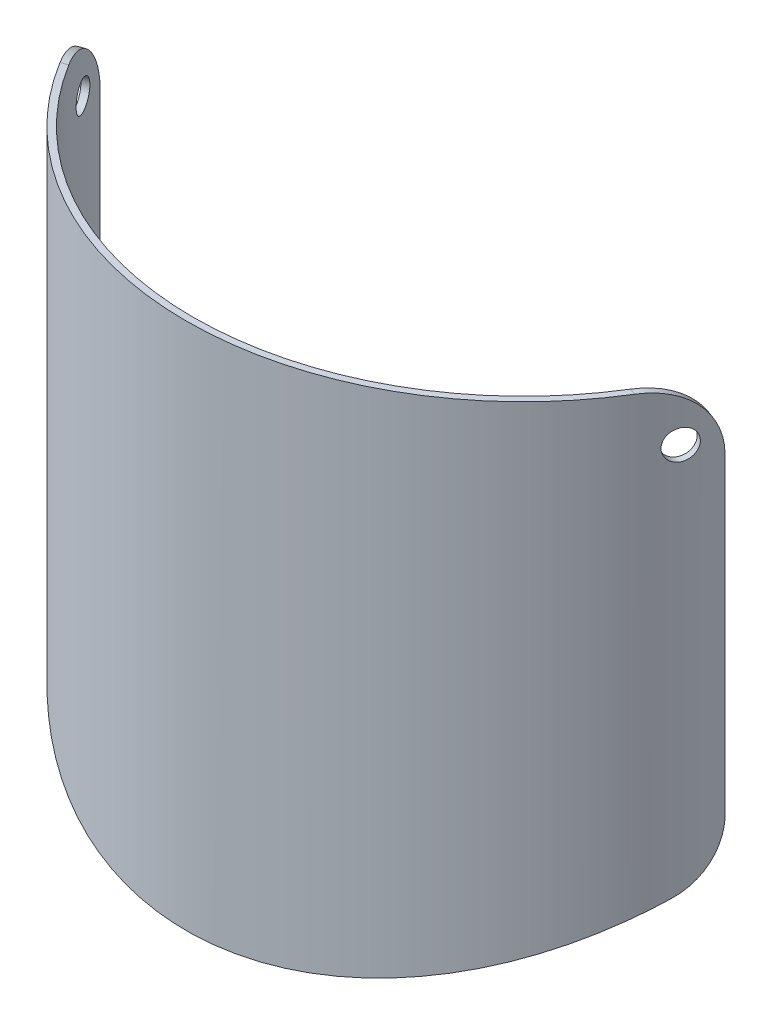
ISO-10303-21;
HEADER;
FILE_DESCRIPTION(('STEP AP214'),'2;1');
FILE_NAME('part.step','',(''),(''),'','','');
FILE_SCHEMA(('AUTOMOTIVE_DESIGN { 1 0 10303 214 1 1 1 1 }'));
ENDSEC;
DATA;
#1=APPLICATION_CONTEXT('core data for automotive mechanical design processes');
#2=APPLICATION_PROTOCOL_DEFINITION('international standard','automotive_design',2000,#1);
#3=PRODUCT_CONTEXT('',#1,'mechanical');
#4=PRODUCT('Part','Part','',(#3));
#5=PRODUCT_RELATED_PRODUCT_CATEGORY('part','',(#4));
#6=PRODUCT_DEFINITION_FORMATION('','',#4);
#7=PRODUCT_DEFINITION_CONTEXT('part definition',#1,'design');
#8=PRODUCT_DEFINITION('design','',#6,#7);
#9=PRODUCT_DEFINITION_SHAPE('','',#8);
#10=(LENGTH_UNIT() NAMED_UNIT(*) SI_UNIT(.MILLI.,.METRE.));
#11=(NAMED_UNIT(*) PLANE_ANGLE_UNIT() SI_UNIT($,.RADIAN.));
#12=(NAMED_UNIT(*) SI_UNIT($,.STERADIAN.) SOLID_ANGLE_UNIT());
#13=UNCERTAINTY_MEASURE_WITH_UNIT(LENGTH_MEASURE(1.E-05),#10,'distance_accuracy_value','');
#14=(GEOMETRIC_REPRESENTATION_CONTEXT(3) GLOBAL_UNCERTAINTY_ASSIGNED_CONTEXT((#13)) GLOBAL_UNIT_ASSIGNED_CONTEXT((#10,
#11,#12)) REPRESENTATION_CONTEXT('',''));
#15=CARTESIAN_POINT('',(0.,0.,0.));
#16=DIRECTION('',(0.,0.,1.));
#17=DIRECTION('',(1.,0.,0.));
#18=AXIS2_PLACEMENT_3D('',#15,#16,#17);
#19=CARTESIAN_POINT('',(0.,-114.748714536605,-53.5082043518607));
#20=DIRECTION('',(0.,0.90630778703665,0.4226182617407));
#21=DIRECTION('',(0.,-0.4226182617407,0.90630778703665));
#22=AXIS2_PLACEMENT_3D('',#19,#20,#21);
#23=PLANE('',#22);
#24=CARTESIAN_POINT('',(0.,-139.7,0.));
#25=DIRECTION('',(0.,0.90630778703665,0.4226182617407));
#26=DIRECTION('',(0.,0.4226182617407,-0.90630778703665));
#27=AXIS2_PLACEMENT_3D('',#24,#25,#26);
#28=ELLIPSE('',#27,140.128995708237,127.);
#29=CARTESIAN_POINT('',(113.232987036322,-166.516909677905,57.5090483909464));
#30=VERTEX_POINT('',#29);
#31=CARTESIAN_POINT('',(-113.232987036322,-166.516909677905,57.5090483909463));
#32=VERTEX_POINT('',#31);
#33=EDGE_CURVE('E151',#30,#32,#28,.F.);
#34=ORIENTED_EDGE('',*,*,#33,.T.);
#35=DIRECTION('',(-0.927964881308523,-0.157496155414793,0.337751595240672));
#36=VECTOR('',#35,1.);
#37=CARTESIAN_POINT('',(26.635244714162,-142.778178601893,6.60117531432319));
#38=LINE('',#37,#36);
#39=CARTESIAN_POINT('',(-110.828264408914,-166.108775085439,56.6338009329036));
#40=VERTEX_POINT('',#39);
#41=EDGE_CURVE('E13',#32,#40,#38,.F.);
#42=ORIENTED_EDGE('',*,*,#41,.T.);
#43=CARTESIAN_POINT('',(0.,-139.7,0.));
#44=DIRECTION('',(0.,0.90630778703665,0.4226182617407));
#45=DIRECTION('',(0.,0.4226182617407,-0.90630778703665));
#46=AXIS2_PLACEMENT_3D('',#43,#44,#45);
#47=ELLIPSE('',#46,137.326415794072,124.46);
#48=CARTESIAN_POINT('',(110.828264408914,-166.108775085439,56.6338009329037));
#49=VERTEX_POINT('',#48);
#50=EDGE_CURVE('E148',#49,#40,#47,.F.);
#51=ORIENTED_EDGE('',*,*,#50,.F.);
#52=DIRECTION('',(-0.927964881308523,0.157496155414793,-0.337751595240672));
#53=VECTOR('',#52,1.);
#54=CARTESIAN_POINT('',(-26.635244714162,-142.778178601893,6.60117531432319));
#55=LINE('',#54,#53);
#56=EDGE_CURVE('E46',#49,#30,#55,.F.);
#57=ORIENTED_EDGE('',*,*,#56,.T.);
#58=EDGE_LOOP('',(#34,#42,#51,#57));
#59=FACE_BOUND('',#58,.T.);
#60=ADVANCED_FACE('F37',(#59),#23,.F.);
#61=CARTESIAN_POINT('',(0.,0.,0.));
#62=DIRECTION('',(-0.342020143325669,0.,0.939692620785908));
#63=DIRECTION('',(0.939692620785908,0.,0.342020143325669));
#64=AXIS2_PLACEMENT_3D('',#61,#62,#63);
#65=PLANE('',#64);
#66=DIRECTION('',(0.,1.,0.));
#67=VECTOR('',#66,1.);
#68=CARTESIAN_POINT('',(116.954143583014,-203.2,42.5678270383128));
#69=LINE('',#68,#67);
#70=CARTESIAN_POINT('',(116.954143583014,-25.4,42.5678270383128));
#71=VERTEX_POINT('',#70);
#72=CARTESIAN_POINT('',(116.954143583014,-142.653825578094,42.5678270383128));
#73=VERTEX_POINT('',#72);
#74=EDGE_CURVE('E169',#71,#73,#69,.F.);
#75=ORIENTED_EDGE('',*,*,#74,.F.);
#76=DIRECTION('',(0.939692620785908,0.,0.342020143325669));
#77=VECTOR('',#76,1.);
#78=CARTESIAN_POINT('',(119.34096283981,-25.4,43.43655820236));
#79=LINE('',#78,#77);
#80=CARTESIAN_POINT('',(119.34096283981,-25.4,43.43655820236));
#81=VERTEX_POINT('',#80);
#82=EDGE_CURVE('E175',#71,#81,#79,.T.);
#83=ORIENTED_EDGE('',*,*,#82,.T.);
#84=DIRECTION('',(0.,1.,0.));
#85=VECTOR('',#84,1.);
#86=CARTESIAN_POINT('',(119.34096283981,-203.2,43.43655820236));
#87=LINE('',#86,#85);
#88=CARTESIAN_POINT('',(119.34096283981,-143.058921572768,43.43655820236));
#89=VERTEX_POINT('',#88);
#90=EDGE_CURVE('E154',#81,#89,#87,.F.);
#91=ORIENTED_EDGE('',*,*,#90,.T.);
#92=DIRECTION('',(-0.927964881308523,0.157496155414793,-0.337751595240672));
#93=VECTOR('',#92,1.);
#94=CARTESIAN_POINT('',(-17.94793307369,-119.757960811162,-6.53251340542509));
#95=LINE('',#94,#93);
#96=EDGE_CURVE('E172',#89,#73,#95,.T.);
#97=ORIENTED_EDGE('',*,*,#96,.T.);
#98=EDGE_LOOP('',(#75,#83,#91,#97));
#99=FACE_BOUND('',#98,.T.);
#100=ADVANCED_FACE('F280',(#99),#65,.F.);
#101=CARTESIAN_POINT('',(0.,-203.2,0.));
#102=DIRECTION('',(0.,1.,0.));
#103=DIRECTION('',(0.,0.,1.));
#104=AXIS2_PLACEMENT_3D('',#101,#102,#103);
#105=CYLINDRICAL_SURFACE('',#104,127.);
#106=CARTESIAN_POINT('',(-111.876626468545,-19.05,60.1050784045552));
#107=CARTESIAN_POINT('',(-111.876625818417,-18.8939756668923,60.1050794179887));
#108=CARTESIAN_POINT('',(-111.879741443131,-18.7379706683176,60.0992813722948));
#109=CARTESIAN_POINT('',(-111.892176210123,-18.427018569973,60.0761273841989));
#110=CARTESIAN_POINT('',(-111.901496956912,-18.2720717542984,60.0587684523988));
#111=CARTESIAN_POINT('',(-111.926272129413,-17.964256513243,60.0125844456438));
#112=CARTESIAN_POINT('',(-111.941731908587,-17.8113900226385,59.9837493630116));
#113=CARTESIAN_POINT('',(-111.978654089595,-17.5089025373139,59.9147941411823));
#114=CARTESIAN_POINT('',(-112.000118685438,-17.3592827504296,59.8746698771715));
#115=CARTESIAN_POINT('',(-112.048836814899,-17.0645403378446,59.7834495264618));
#116=CARTESIAN_POINT('',(-112.076085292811,-16.9194139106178,59.7323630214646));
#117=CARTESIAN_POINT('',(-112.136154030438,-16.634498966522,59.6195189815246));
#118=CARTESIAN_POINT('',(-112.16897634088,-16.4947124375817,59.5577575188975));
#119=CARTESIAN_POINT('',(-112.239877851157,-16.2216089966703,59.4240316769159));
#120=CARTESIAN_POINT('',(-112.277953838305,-16.0882881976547,59.3520735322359));
#121=CARTESIAN_POINT('',(-112.359064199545,-15.8289212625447,59.1983803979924));
#122=CARTESIAN_POINT('',(-112.402100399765,-15.702877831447,59.1166418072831));
#123=CARTESIAN_POINT('',(-112.492767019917,-15.4589711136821,58.9439299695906));
#124=CARTESIAN_POINT('',(-112.540398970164,-15.3411105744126,58.8529536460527));
#125=CARTESIAN_POINT('',(-112.639860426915,-15.1144093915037,58.6623678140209));
#126=CARTESIAN_POINT('',(-112.691691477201,-15.0055720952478,58.5627551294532));
#127=CARTESIAN_POINT('',(-112.799084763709,-14.7977724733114,58.3556344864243));
#128=CARTESIAN_POINT('',(-112.854645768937,-14.6988069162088,58.2481291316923));
#129=CARTESIAN_POINT('',(-112.969076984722,-14.5113778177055,58.025884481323));
#130=CARTESIAN_POINT('',(-113.027948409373,-14.4229181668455,57.9111425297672));
#131=CARTESIAN_POINT('',(-113.148504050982,-14.2571710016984,57.6752422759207));
#132=CARTESIAN_POINT('',(-113.210188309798,-14.1798836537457,57.554083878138));
#133=CARTESIAN_POINT('',(-113.335895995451,-14.0370066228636,57.3061428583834));
#134=CARTESIAN_POINT('',(-113.399920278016,-13.97142127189,57.1793581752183));
#135=CARTESIAN_POINT('',(-113.52976313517,-13.8524732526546,56.9211185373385));
#136=CARTESIAN_POINT('',(-113.595581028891,-13.7991060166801,56.7896653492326));
#137=CARTESIAN_POINT('',(-113.728524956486,-13.704928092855,56.5229590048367));
#138=CARTESIAN_POINT('',(-113.795651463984,-13.6641220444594,56.3877044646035));
#139=CARTESIAN_POINT('',(-113.998090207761,-13.5611264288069,55.97792140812));
#140=CARTESIAN_POINT('',(-114.134688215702,-13.5181526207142,55.6989234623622));
#141=CARTESIAN_POINT('',(-114.406944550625,-13.4849885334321,55.1375420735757));
#142=CARTESIAN_POINT('',(-114.542602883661,-13.4947979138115,54.8551586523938));
#143=CARTESIAN_POINT('',(-114.80915799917,-13.5668258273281,54.2950579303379));
#144=CARTESIAN_POINT('',(-114.94005797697,-13.6290084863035,54.0173375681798));
#145=CARTESIAN_POINT('',(-115.193661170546,-13.8039804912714,53.4743891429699));
#146=CARTESIAN_POINT('',(-115.316364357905,-13.9167700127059,53.2091611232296));
#147=CARTESIAN_POINT('',(-115.550498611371,-14.1897901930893,52.6987780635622));
#148=CARTESIAN_POINT('',(-115.66192576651,-14.3500372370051,52.453629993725));
#149=CARTESIAN_POINT('',(-115.870767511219,-14.7134129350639,51.990670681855));
#150=CARTESIAN_POINT('',(-115.968182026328,-14.9165418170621,51.7728595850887));
#151=CARTESIAN_POINT('',(-116.146837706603,-15.3601177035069,51.3708150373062));
#152=CARTESIAN_POINT('',(-116.228065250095,-15.6005958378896,51.1866098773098));
#153=CARTESIAN_POINT('',(-116.372460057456,-16.111934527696,50.8574768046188));
#154=CARTESIAN_POINT('',(-116.435627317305,-16.3827950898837,50.7125489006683));
#155=CARTESIAN_POINT('',(-116.54256659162,-16.9472283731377,50.4663083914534));
#156=CARTESIAN_POINT('',(-116.586338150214,-17.2408016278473,50.3649968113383));
#157=CARTESIAN_POINT('',(-116.653582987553,-17.8423184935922,50.2090514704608));
#158=CARTESIAN_POINT('',(-116.677056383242,-18.1502620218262,50.154417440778));
#159=CARTESIAN_POINT('',(-116.703219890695,-18.7715046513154,50.0935084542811));
#160=CARTESIAN_POINT('',(-116.705927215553,-19.0847991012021,50.0871934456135));
#161=CARTESIAN_POINT('',(-116.690549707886,-19.7080905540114,50.123008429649));
#162=CARTESIAN_POINT('',(-116.672464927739,-20.0180875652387,50.1651383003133));
#163=CARTESIAN_POINT('',(-116.615878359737,-20.6258624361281,50.2965403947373));
#164=CARTESIAN_POINT('',(-116.577384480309,-20.9236449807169,50.385794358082));
#165=CARTESIAN_POINT('',(-116.480770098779,-21.4986821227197,50.6087430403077));
#166=CARTESIAN_POINT('',(-116.422649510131,-21.7759366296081,50.7424379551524));
#167=CARTESIAN_POINT('',(-116.287953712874,-22.302247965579,51.0503670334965));
#168=CARTESIAN_POINT('',(-116.211366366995,-22.5512860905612,51.2246278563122));
#169=CARTESIAN_POINT('',(-116.041419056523,-23.0139072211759,51.6084585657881));
#170=CARTESIAN_POINT('',(-115.948059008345,-23.2274900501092,51.818028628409));
#171=CARTESIAN_POINT('',(-115.746616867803,-23.6132842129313,52.2664426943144));
#172=CARTESIAN_POINT('',(-115.638524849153,-23.7854674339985,52.5053064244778));
#173=CARTESIAN_POINT('',(-115.410240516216,-24.0833809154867,53.0052050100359));
#174=CARTESIAN_POINT('',(-115.290048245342,-24.2091113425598,53.2662397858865));
#175=CARTESIAN_POINT('',(-115.040658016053,-24.4105071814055,53.8027368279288));
#176=CARTESIAN_POINT('',(-114.91146332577,-24.4861906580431,54.0781938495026));
#177=CARTESIAN_POINT('',(-114.647357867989,-24.5853802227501,54.6358696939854));
#178=CARTESIAN_POINT('',(-114.51244712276,-24.6088865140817,54.9180884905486));
#179=CARTESIAN_POINT('',(-114.308865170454,-24.6045736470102,55.3399311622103));
#180=CARTESIAN_POINT('',(-114.240793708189,-24.5965373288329,55.48031441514));
#181=CARTESIAN_POINT('',(-114.104682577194,-24.5673686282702,55.7597119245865));
#182=CARTESIAN_POINT('',(-114.036642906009,-24.5462410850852,55.8987266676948));
#183=CARTESIAN_POINT('',(-113.901068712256,-24.4910247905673,56.1744620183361));
#184=CARTESIAN_POINT('',(-113.833534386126,-24.4569312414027,56.3111817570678));
#185=CARTESIAN_POINT('',(-113.699523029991,-24.3760448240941,56.5812793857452));
#186=CARTESIAN_POINT('',(-113.633045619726,-24.3292566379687,56.7146584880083));
#187=CARTESIAN_POINT('',(-113.501608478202,-24.2232881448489,56.977244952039));
#188=CARTESIAN_POINT('',(-113.4366493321,-24.1641031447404,57.1064507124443));
#189=CARTESIAN_POINT('',(-113.308804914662,-24.0337976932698,57.3596970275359));
#190=CARTESIAN_POINT('',(-113.245918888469,-23.9626816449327,57.48373946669));
#191=CARTESIAN_POINT('',(-113.122673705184,-23.8089785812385,57.7258967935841));
#192=CARTESIAN_POINT('',(-113.06231540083,-23.7263877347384,57.8440096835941));
#193=CARTESIAN_POINT('',(-112.944656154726,-23.5503722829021,58.0734126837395));
#194=CARTESIAN_POINT('',(-112.88735409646,-23.456951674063,58.1847052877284));
#195=CARTESIAN_POINT('',(-112.776190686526,-23.2598061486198,58.3998758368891));
#196=CARTESIAN_POINT('',(-112.722333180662,-23.1560700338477,58.5037455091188));
#197=CARTESIAN_POINT('',(-112.618594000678,-22.9391556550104,58.7031934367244));
#198=CARTESIAN_POINT('',(-112.568710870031,-22.8259808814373,58.7987747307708));
#199=CARTESIAN_POINT('',(-112.473288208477,-22.5908857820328,58.9810989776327));
#200=CARTESIAN_POINT('',(-112.42775137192,-22.4689601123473,59.0678364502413));
#201=CARTESIAN_POINT('',(-112.341459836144,-22.2173367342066,59.2317903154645));
#202=CARTESIAN_POINT('',(-112.300703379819,-22.0876419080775,59.3090102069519));
#203=CARTESIAN_POINT('',(-112.224257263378,-21.82119706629,59.4535345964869));
#204=CARTESIAN_POINT('',(-112.188573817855,-21.6844386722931,59.5208269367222));
#205=CARTESIAN_POINT('',(-112.122655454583,-21.4050367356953,59.6449081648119));
#206=CARTESIAN_POINT('',(-112.092418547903,-21.2623953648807,59.7017008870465));
#207=CARTESIAN_POINT('',(-112.037666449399,-20.9723192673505,59.8043868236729));
#208=CARTESIAN_POINT('',(-112.01314625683,-20.8248888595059,59.8502895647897));
#209=CARTESIAN_POINT('',(-111.970016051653,-20.5262155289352,59.9309401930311));
#210=CARTESIAN_POINT('',(-111.951404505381,-20.3749736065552,59.9656909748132));
#211=CARTESIAN_POINT('',(-111.916188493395,-20.029910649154,60.0313960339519));
#212=CARTESIAN_POINT('',(-111.901369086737,-19.8352586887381,60.0590045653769));
#213=CARTESIAN_POINT('',(-111.881588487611,-19.4437275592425,60.0958451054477));
#214=CARTESIAN_POINT('',(-111.876627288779,-19.2468483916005,60.1050771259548));
#215=CARTESIAN_POINT('',(-111.876626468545,-19.05,60.1050784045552));
#216=B_SPLINE_CURVE_WITH_KNOTS('',3,(#106,#107,#108,#109,#110,#111,#112,#113,#114,#115,#116,
#117,#118,#119,#120,#121,#122,#123,#124,#125,#126,#127,#128,#129,#130,#131,#132,#133,#134,#135,
#136,#137,#138,#139,#140,#141,#142,#143,#144,#145,#146,#147,#148,#149,#150,#151,#152,#153,#154,
#155,#156,#157,#158,#159,#160,#161,#162,#163,#164,#165,#166,#167,#168,#169,#170,#171,#172,#173,
#174,#175,#176,#177,#178,#179,#180,#181,#182,#183,#184,#185,#186,#187,#188,#189,#190,#191,#192,
#193,#194,#195,#196,#197,#198,#199,#200,#201,#202,#203,#204,#205,#206,#207,#208,#209,#210,#211,
#212,#213,#214,#215),.UNSPECIFIED.,.T.,.F.,(4,2,2,2,2,2,2,2,2,2,2,2,2,2,2,2,2,2,2,2,2,2,2,2,2,2,
2,2,2,2,2,2,2,2,2,2,2,2,2,2,2,2,2,2,2,2,2,2,2,2,2,2,2,2,4),(0.,0.467901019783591,
0.935923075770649,1.40435416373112,1.87295662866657,2.34115116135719,2.80951832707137,
3.27760033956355,3.74585523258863,4.21426658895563,4.68285094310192,5.15128140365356,
5.61988479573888,6.0884951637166,6.55727864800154,7.02588659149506,7.49466740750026,
8.43061591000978,9.36655837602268,10.3018602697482,11.2371654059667,12.172793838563,
13.1084272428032,14.0448447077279,14.9812623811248,15.9177020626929,16.8541363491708,
17.7897943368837,18.7254499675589,19.6607433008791,20.5960407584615,21.5319546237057,
22.4678731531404,23.4044254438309,24.3409743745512,25.2771850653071,26.213392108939,
26.6816070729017,27.1496490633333,27.6178644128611,28.0859073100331,28.5541277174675,
29.022175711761,29.4903803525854,29.9584127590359,30.4269589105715,30.8953325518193,
31.3639946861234,31.8324840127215,32.3015423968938,32.7704291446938,33.2389041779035,
33.7072575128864,34.297586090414,34.8879142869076),.UNSPECIFIED.);
#217=CARTESIAN_POINT('',(-114.399102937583,-13.49375,55.1529260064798));
#218=VERTEX_POINT('',#217);
#219=CARTESIAN_POINT('',(-114.399102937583,-24.60625,55.1529260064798));
#220=VERTEX_POINT('',#219);
#221=EDGE_CURVE('E52',#218,#220,#216,.T.);
#222=ORIENTED_EDGE('',*,*,#221,.F.);
#223=EDGE_CURVE('E111',#220,#218,#216,.T.);
#224=ORIENTED_EDGE('',*,*,#223,.F.);
#225=EDGE_LOOP('',(#222,#224));
#226=FACE_BOUND('',#225,.T.);
#227=CARTESIAN_POINT('',(116.702507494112,-19.05,50.0951568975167));
#228=CARTESIAN_POINT('',(116.702507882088,-18.8939756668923,50.0951557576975));
#229=CARTESIAN_POINT('',(116.699912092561,-18.7379706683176,50.1012044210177));
#230=CARTESIAN_POINT('',(116.689541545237,-18.427018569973,50.1253535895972));
#231=CARTESIAN_POINT('',(116.681765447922,-18.2720717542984,50.143457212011));
#232=CARTESIAN_POINT('',(116.66106257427,-17.964256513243,50.1916045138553));
#233=CARTESIAN_POINT('',(116.64813130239,-17.8113900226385,50.2216586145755));
#234=CARTESIAN_POINT('',(116.617178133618,-17.5089025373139,50.2934915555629));
#235=CARTESIAN_POINT('',(116.599154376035,-17.3592827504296,50.33527468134));
#236=CARTESIAN_POINT('',(116.55812821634,-17.0645403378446,50.4302034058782));
#237=CARTESIAN_POINT('',(116.535130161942,-16.9194139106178,50.4833390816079));
#238=CARTESIAN_POINT('',(116.484255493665,-16.634498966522,50.6006156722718));
#239=CARTESIAN_POINT('',(116.456377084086,-16.4947124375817,50.6647606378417));
#240=CARTESIAN_POINT('',(116.395911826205,-16.2216089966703,50.8035178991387));
#241=CARTESIAN_POINT('',(116.363327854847,-16.0882881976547,50.8781237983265));
#242=CARTESIAN_POINT('',(116.29359890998,-15.8289212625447,51.0373040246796));
#243=CARTESIAN_POINT('',(116.256452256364,-15.702877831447,51.1218820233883));
#244=CARTESIAN_POINT('',(116.177795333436,-15.4589711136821,51.3003838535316));
#245=CARTESIAN_POINT('',(116.136283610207,-15.3411105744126,51.3943107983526));
#246=CARTESIAN_POINT('',(116.049120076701,-15.1144093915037,51.5908255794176));
#247=CARTESIAN_POINT('',(116.003466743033,-15.0055720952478,51.6934166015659));
#248=CARTESIAN_POINT('',(115.908306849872,-14.7977724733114,51.9064350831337));
#249=CARTESIAN_POINT('',(115.85880156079,-14.6988069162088,52.0168599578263));
#250=CARTESIAN_POINT('',(115.756192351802,-14.5113778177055,52.2448041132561));
#251=CARTESIAN_POINT('',(115.703087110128,-14.4229181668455,52.3623259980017));
#252=CARTESIAN_POINT('',(115.593608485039,-14.2571710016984,52.6035665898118));
#253=CARTESIAN_POINT('',(115.537235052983,-14.1798836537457,52.7272853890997));
#254=CARTESIAN_POINT('',(115.421544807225,-14.0370066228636,52.9800559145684));
#255=CARTESIAN_POINT('',(115.362226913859,-13.97142127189,53.1091095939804));
#256=CARTESIAN_POINT('',(115.241054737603,-13.8524732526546,53.3715294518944));
#257=CARTESIAN_POINT('',(115.179201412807,-13.7991060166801,53.5048939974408));
#258=CARTESIAN_POINT('',(115.053336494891,-13.704928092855,53.7750132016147));
#259=CARTESIAN_POINT('',(114.989324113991,-13.6641220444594,53.9117690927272));
#260=CARTESIAN_POINT('',(114.794801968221,-13.5611264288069,54.3253688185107));
#261=CARTESIAN_POINT('',(114.661596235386,-13.5181526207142,54.6060022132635));
#262=CARTESIAN_POINT('',(114.391950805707,-13.4849885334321,55.1686423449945));
#263=CARTESIAN_POINT('',(114.255511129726,-13.4947979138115,55.4506490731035));
#264=CARTESIAN_POINT('',(113.983316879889,-13.5668258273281,56.0080311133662));
#265=CARTESIAN_POINT('',(113.847561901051,-13.6290084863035,56.2834108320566));
#266=CARTESIAN_POINT('',(113.580720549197,-13.8039804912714,56.8199770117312));
#267=CARTESIAN_POINT('',(113.449634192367,-13.9167700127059,57.0811634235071));
#268=CARTESIAN_POINT('',(113.196145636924,-14.1897901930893,57.5822155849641));
#269=CARTESIAN_POINT('',(113.073746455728,-14.3500372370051,57.8220739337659));
#270=CARTESIAN_POINT('',(112.841608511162,-14.7134129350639,58.273801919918));
#271=CARTESIAN_POINT('',(112.731869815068,-14.9165418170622,58.4856714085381));
#272=CARTESIAN_POINT('',(112.528589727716,-15.3601177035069,58.8758442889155));
#273=CARTESIAN_POINT('',(112.43506198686,-15.6005958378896,59.0541194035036));
#274=CARTESIAN_POINT('',(112.267487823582,-16.111934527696,59.3720774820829));
#275=CARTESIAN_POINT('',(112.193441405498,-16.3827950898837,59.5117604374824));
#276=CARTESIAN_POINT('',(112.067392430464,-16.9472283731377,59.7487879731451));
#277=CARTESIAN_POINT('',(112.015390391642,-17.2408016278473,59.8461315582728));
#278=CARTESIAN_POINT('',(111.935263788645,-17.8423184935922,59.9958664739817));
#279=CARTESIAN_POINT('',(111.907139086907,-18.1502620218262,60.0482580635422));
#280=CARTESIAN_POINT('',(111.875780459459,-18.7715046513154,60.1066624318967));
#281=CARTESIAN_POINT('',(111.872525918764,-19.0847991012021,60.1127136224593));
#282=CARTESIAN_POINT('',(111.89096931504,-19.7080905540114,60.0783767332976));
#283=CARTESIAN_POINT('',(111.912667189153,-20.0180875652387,60.0379887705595));
#284=CARTESIAN_POINT('',(111.98022990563,-20.6258624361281,59.9118783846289));
#285=CARTESIAN_POINT('',(112.026085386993,-20.9236449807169,59.8261735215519));
#286=CARTESIAN_POINT('',(112.140341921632,-21.4986821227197,59.611730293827));
#287=CARTESIAN_POINT('',(112.208743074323,-21.7759366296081,59.4829917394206));
#288=CARTESIAN_POINT('',(112.365768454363,-22.302247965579,59.1858279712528));
#289=CARTESIAN_POINT('',(112.454405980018,-22.5512860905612,59.0173766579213));
#290=CARTESIAN_POINT('',(112.648859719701,-23.0139072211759,58.6453607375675));
#291=CARTESIAN_POINT('',(112.754676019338,-23.2274900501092,58.4417959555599));
#292=CARTESIAN_POINT('',(112.980042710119,-23.6132842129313,58.0049161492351));
#293=CARTESIAN_POINT('',(113.09960235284,-23.7854674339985,57.7715810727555));
#294=CARTESIAN_POINT('',(113.348531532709,-24.0833809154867,57.2816355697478));
#295=CARTESIAN_POINT('',(113.47790103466,-24.2091113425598,57.0250252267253));
#296=CARTESIAN_POINT('',(113.742318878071,-24.4105071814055,56.4957731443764));
#297=CARTESIAN_POINT('',(113.877365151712,-24.4861906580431,56.2231372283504));
#298=CARTESIAN_POINT('',(114.149187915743,-24.5853802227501,55.6691819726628));
#299=CARTESIAN_POINT('',(114.285964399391,-24.6088865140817,55.3878626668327));
#300=CARTESIAN_POINT('',(114.489209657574,-24.6045736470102,54.9658576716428));
#301=CARTESIAN_POINT('',(114.556646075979,-24.5965373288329,54.8251682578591));
#302=CARTESIAN_POINT('',(114.69046764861,-24.5673686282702,54.5446669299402));
#303=CARTESIAN_POINT('',(114.756853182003,-24.5462410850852,54.40485471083));
#304=CARTESIAN_POINT('',(114.888143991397,-24.4910247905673,54.1270542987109));
#305=CARTESIAN_POINT('',(114.953048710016,-24.4569312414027,53.9890668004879));
#306=CARTESIAN_POINT('',(115.080902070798,-24.3760448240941,53.7160003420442));
#307=CARTESIAN_POINT('',(115.143851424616,-24.3292566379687,53.5809203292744));
#308=CARTESIAN_POINT('',(115.267431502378,-24.223288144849,53.3145458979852));
#309=CARTESIAN_POINT('',(115.328061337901,-24.1641031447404,53.1832529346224));
#310=CARTESIAN_POINT('',(115.446571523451,-24.0337976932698,52.9255064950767));
#311=CARTESIAN_POINT('',(115.504452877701,-23.9626816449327,52.7990512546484));
#312=CARTESIAN_POINT('',(115.617151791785,-23.8089785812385,52.5518094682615));
#313=CARTESIAN_POINT('',(115.671968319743,-23.7263877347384,52.4310248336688));
#314=CARTESIAN_POINT('',(115.778167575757,-23.5503722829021,52.1960968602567));
#315=CARTESIAN_POINT('',(115.829551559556,-23.456951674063,52.0819510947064));
#316=CARTESIAN_POINT('',(115.928661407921,-23.2598061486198,51.8609694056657));
#317=CARTESIAN_POINT('',(115.976383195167,-23.1560700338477,51.7541416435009));
#318=CARTESIAN_POINT('',(116.06781598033,-22.9391556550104,51.5487606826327));
#319=CARTESIAN_POINT('',(116.111528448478,-22.8259808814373,51.4502044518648));
#320=CARTESIAN_POINT('',(116.194743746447,-22.5908857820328,51.2619949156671));
#321=CARTESIAN_POINT('',(116.234243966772,-22.4689601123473,51.1723471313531));
#322=CARTESIAN_POINT('',(116.308773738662,-22.2173367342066,51.0027228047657));
#323=CARTESIAN_POINT('',(116.343804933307,-22.0876419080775,50.9227427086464));
#324=CARTESIAN_POINT('',(116.409265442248,-21.82119706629,50.7729220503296));
#325=CARTESIAN_POINT('',(116.439689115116,-21.6844386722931,50.7030939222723));
#326=CARTESIAN_POINT('',(116.495712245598,-21.4050367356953,50.5742421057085));
#327=CARTESIAN_POINT('',(116.5213134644,-21.2623953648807,50.5152144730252));
#328=CARTESIAN_POINT('',(116.567551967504,-20.9723192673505,50.4084240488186));
#329=CARTESIAN_POINT('',(116.58819359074,-20.8248888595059,50.360651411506));
#330=CARTESIAN_POINT('',(116.624430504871,-20.5262155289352,50.2766774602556));
#331=CARTESIAN_POINT('',(116.640027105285,-20.3749736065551,50.240473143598));
#332=CARTESIAN_POINT('',(116.669500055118,-20.029910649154,50.1719992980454));
#333=CARTESIAN_POINT('',(116.681870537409,-19.8352586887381,50.1432101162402));
#334=CARTESIAN_POINT('',(116.698374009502,-19.4437275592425,50.1047896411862));
#335=CARTESIAN_POINT('',(116.70250700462,-19.2468483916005,50.0951583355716));
#336=CARTESIAN_POINT('',(116.702507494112,-19.05,50.0951568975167));
#337=B_SPLINE_CURVE_WITH_KNOTS('',3,(#227,#228,#229,#230,#231,#232,#233,#234,#235,#236,#237,
#238,#239,#240,#241,#242,#243,#244,#245,#246,#247,#248,#249,#250,#251,#252,#253,#254,#255,#256,
#257,#258,#259,#260,#261,#262,#263,#264,#265,#266,#267,#268,#269,#270,#271,#272,#273,#274,#275,
#276,#277,#278,#279,#280,#281,#282,#283,#284,#285,#286,#287,#288,#289,#290,#291,#292,#293,#294,
#295,#296,#297,#298,#299,#300,#301,#302,#303,#304,#305,#306,#307,#308,#309,#310,#311,#312,#313,
#314,#315,#316,#317,#318,#319,#320,#321,#322,#323,#324,#325,#326,#327,#328,#329,#330,#331,#332,
#333,#334,#335,#336),.UNSPECIFIED.,.T.,.F.,(4,2,2,2,2,2,2,2,2,2,2,2,2,2,2,2,2,2,2,2,2,2,2,2,2,2,
2,2,2,2,2,2,2,2,2,2,2,2,2,2,2,2,2,2,2,2,2,2,2,2,2,2,2,2,4),(0.,0.467901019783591,
0.935923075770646,1.40435416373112,1.87295662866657,2.3411511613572,2.80951832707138,
3.27760033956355,3.74585523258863,4.21426658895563,4.68285094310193,5.15128140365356,
5.61988479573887,6.08849516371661,6.55727864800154,7.02588659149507,7.49466740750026,
8.43061591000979,9.36655837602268,10.3018602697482,11.2371654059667,12.172793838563,
13.1084272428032,14.0448447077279,14.9812623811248,15.917702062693,16.8541363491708,
17.7897943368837,18.725449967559,19.6607433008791,20.5960407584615,21.5319546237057,
22.4678731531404,23.4044254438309,24.3409743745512,25.2771850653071,26.213392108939,
26.6816070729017,27.1496490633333,27.6178644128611,28.0859073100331,28.5541277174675,
29.022175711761,29.4903803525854,29.9584127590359,30.4269589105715,30.8953325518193,
31.3639946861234,31.8324840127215,32.3015423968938,32.7704291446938,33.2389041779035,
33.7072575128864,34.297586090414,34.8879142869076),.UNSPECIFIED.);
#338=CARTESIAN_POINT('',(114.399102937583,-13.49375,55.1529260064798));
#339=VERTEX_POINT('',#338);
#340=CARTESIAN_POINT('',(114.399102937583,-24.60625,55.1529260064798));
#341=VERTEX_POINT('',#340);
#342=EDGE_CURVE('E59',#339,#341,#337,.T.);
#343=ORIENTED_EDGE('',*,*,#342,.F.);
#344=EDGE_CURVE('E120',#341,#339,#337,.T.);
#345=ORIENTED_EDGE('',*,*,#344,.F.);
#346=EDGE_LOOP('',(#343,#345));
#347=FACE_BOUND('',#346,.T.);
#348=ORIENTED_EDGE('',*,*,#90,.F.);
#349=CARTESIAN_POINT('',(119.34096283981,-25.4,43.43655820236));
#350=CARTESIAN_POINT('',(119.340960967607,-25.0429128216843,43.4365570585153));
#351=CARTESIAN_POINT('',(119.338387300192,-24.6858653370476,43.4436352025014));
#352=CARTESIAN_POINT('',(119.328086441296,-23.9724136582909,43.4719233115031));
#353=CARTESIAN_POINT('',(119.320359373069,-23.6160094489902,43.4931329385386));
#354=CARTESIAN_POINT('',(119.28943827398,-22.5487645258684,43.577904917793));
#355=CARTESIAN_POINT('',(119.25850435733,-21.8397076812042,43.6626103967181));
#356=CARTESIAN_POINT('',(119.175881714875,-20.4321987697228,43.887623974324));
#357=CARTESIAN_POINT('',(119.124207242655,-19.7337397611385,44.0278938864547));
#358=CARTESIAN_POINT('',(119.030991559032,-18.6975463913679,44.2790116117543));
#359=CARTESIAN_POINT('',(118.997300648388,-18.3540507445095,44.36950749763));
#360=CARTESIAN_POINT('',(118.924636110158,-17.671343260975,44.5639058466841));
#361=CARTESIAN_POINT('',(118.88566112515,-17.332132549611,44.6678117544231));
#362=CARTESIAN_POINT('',(118.760737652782,-16.3217509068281,44.999369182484));
#363=CARTESIAN_POINT('',(118.666800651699,-15.657942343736,45.2468332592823));
#364=CARTESIAN_POINT('',(118.457336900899,-14.3550031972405,45.7924076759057));
#365=CARTESIAN_POINT('',(118.34181020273,-13.7158725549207,46.090517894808));
#366=CARTESIAN_POINT('',(118.152128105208,-12.7792398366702,46.5736457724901));
#367=CARTESIAN_POINT('',(118.086161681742,-12.4706778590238,46.740699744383));
#368=CARTESIAN_POINT('',(117.948737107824,-11.861486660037,47.086410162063));
#369=CARTESIAN_POINT('',(117.877280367,-11.560855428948,47.2650636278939));
#370=CARTESIAN_POINT('',(117.654580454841,-10.6715064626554,47.8179634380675));
#371=CARTESIAN_POINT('',(117.494994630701,-10.0952691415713,48.2091824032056));
#372=CARTESIAN_POINT('',(117.153741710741,-8.98152969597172,49.0326323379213));
#373=CARTESIAN_POINT('',(116.972111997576,-8.44396439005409,49.464793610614));
#374=CARTESIAN_POINT('',(116.586451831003,-7.41025902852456,50.3670513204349));
#375=CARTESIAN_POINT('',(116.382421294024,-6.91411912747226,50.8371478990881));
#376=CARTESIAN_POINT('',(115.952041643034,-5.96682589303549,51.8112682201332));
#377=CARTESIAN_POINT('',(115.725691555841,-5.51567452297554,52.3152934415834));
#378=CARTESIAN_POINT('',(115.250979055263,-4.66158981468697,53.3529498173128));
#379=CARTESIAN_POINT('',(115.002617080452,-4.25865551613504,53.8865803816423));
#380=CARTESIAN_POINT('',(114.486197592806,-3.5063913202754,54.9751849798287));
#381=CARTESIAN_POINT('',(114.218286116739,-3.15671424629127,55.5299884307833));
#382=CARTESIAN_POINT('',(113.662084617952,-2.51000580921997,56.6597465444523));
#383=CARTESIAN_POINT('',(113.373793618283,-2.2129769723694,57.2347021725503));
#384=CARTESIAN_POINT('',(112.778031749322,-1.67352850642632,58.3998596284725));
#385=CARTESIAN_POINT('',(112.47056549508,-1.43109580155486,58.9900577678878));
#386=CARTESIAN_POINT('',(111.837823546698,-1.00216971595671,60.1810234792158));
#387=CARTESIAN_POINT('',(111.512551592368,-0.815664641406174,60.7817888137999));
#388=CARTESIAN_POINT('',(110.948012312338,-0.547864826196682,61.8042699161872));
#389=CARTESIAN_POINT('',(110.712902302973,-0.451840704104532,62.2244922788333));
#390=CARTESIAN_POINT('',(110.235595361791,-0.287270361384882,63.0662151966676));
#391=CARTESIAN_POINT('',(109.993399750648,-0.21871905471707,63.487715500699));
#392=CARTESIAN_POINT('',(109.50298195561,-0.109222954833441,64.3298827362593));
#393=CARTESIAN_POINT('',(109.25476985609,-0.0682348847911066,64.7505499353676));
#394=CARTESIAN_POINT('',(108.752675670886,-0.0136130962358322,65.5903634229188));
#395=CARTESIAN_POINT('',(108.498792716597,1.64023017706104E-05,66.009509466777));
#396=CARTESIAN_POINT('',(108.242474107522,0.,66.4271540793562));
#397=B_SPLINE_CURVE_WITH_KNOTS('',3,(#349,#350,#351,#352,#353,#354,#355,#356,#357,#358,#359,
#360,#361,#362,#363,#364,#365,#366,#367,#368,#369,#370,#371,#372,#373,#374,#375,#376,#377,#378,
#379,#380,#381,#382,#383,#384,#385,#386,#387,#388,#389,#390,#391,#392,#393,#394,#395,#396),
.UNSPECIFIED.,.F.,.F.,(4,2,2,2,2,2,2,2,2,2,2,2,2,2,2,2,2,2,2,2,2,2,2,4),(0.,1.07110288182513,
2.14218014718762,4.28378496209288,6.42392050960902,7.49407519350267,8.56450531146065,
10.7057110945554,12.8469117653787,13.9177156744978,14.9882455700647,17.1290854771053,
19.2663443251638,21.4036111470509,23.5409711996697,25.6782886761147,27.8010147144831,
29.9238425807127,32.0461614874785,34.1680363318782,35.6402879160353,37.1122668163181,
38.581929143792,40.0518181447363),.UNSPECIFIED.);
#398=CARTESIAN_POINT('',(108.242474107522,0.,66.4271540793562));
#399=VERTEX_POINT('',#398);
#400=EDGE_CURVE('E246',#81,#399,#397,.T.);
#401=ORIENTED_EDGE('',*,*,#400,.T.);
#402=CARTESIAN_POINT('',(0.,0.,0.));
#403=DIRECTION('',(0.,1.,0.));
#404=DIRECTION('',(0.,0.,1.));
#405=AXIS2_PLACEMENT_3D('',#402,#403,#404);
#406=CIRCLE('',#405,127.);
#407=CARTESIAN_POINT('',(-108.242474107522,0.,66.4271540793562));
#408=VERTEX_POINT('',#407);
#409=EDGE_CURVE('E163',#408,#399,#406,.T.);
#410=ORIENTED_EDGE('',*,*,#409,.F.);
#411=CARTESIAN_POINT('',(-108.242474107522,0.,66.4271540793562));
#412=CARTESIAN_POINT('',(-108.428970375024,-3.31393607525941E-07,66.1232636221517));
#413=CARTESIAN_POINT('',(-108.61416235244,-0.00720858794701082,65.8186195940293));
#414=CARTESIAN_POINT('',(-108.981679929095,-0.0360975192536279,65.2082838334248));
#415=CARTESIAN_POINT('',(-109.164005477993,-0.0577784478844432,64.9025920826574));
#416=CARTESIAN_POINT('',(-109.70623377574,-0.14460635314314,63.9847389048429));
#417=CARTESIAN_POINT('',(-110.061442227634,-0.23153841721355,63.3717114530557));
#418=CARTESIAN_POINT('',(-110.756740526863,-0.463381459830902,62.1485266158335));
#419=CARTESIAN_POINT('',(-111.096837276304,-0.608265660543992,61.5383680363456));
#420=CARTESIAN_POINT('',(-111.76018118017,-0.955471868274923,60.3252825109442));
#421=CARTESIAN_POINT('',(-112.083429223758,-1.1577908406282,59.7223551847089));
#422=CARTESIAN_POINT('',(-112.711776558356,-1.61908924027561,58.5278687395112));
#423=CARTESIAN_POINT('',(-113.01685484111,-1.87813269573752,57.9363232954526));
#424=CARTESIAN_POINT('',(-113.607116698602,-2.45119877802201,56.7701522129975));
#425=CARTESIAN_POINT('',(-113.892299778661,-2.76522277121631,56.1955269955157));
#426=CARTESIAN_POINT('',(-114.441605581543,-3.44606282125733,55.0682481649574));
#427=CARTESIAN_POINT('',(-114.705736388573,-3.81285846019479,54.5155861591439));
#428=CARTESIAN_POINT('',(-115.21230671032,-4.59681539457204,53.4366878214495));
#429=CARTESIAN_POINT('',(-115.454746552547,-5.0139759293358,52.9104510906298));
#430=CARTESIAN_POINT('',(-115.915065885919,-5.89115768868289,51.8941763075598));
#431=CARTESIAN_POINT('',(-116.133173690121,-6.35069039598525,51.4038198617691));
#432=CARTESIAN_POINT('',(-116.547457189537,-7.31299525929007,50.4574780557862));
#433=CARTESIAN_POINT('',(-116.74363291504,-7.81576735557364,50.001492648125));
#434=CARTESIAN_POINT('',(-117.114067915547,-8.86115745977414,49.1275937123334));
#435=CARTESIAN_POINT('',(-117.288321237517,-9.40378622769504,48.709690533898));
#436=CARTESIAN_POINT('',(-117.614964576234,-10.5249466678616,47.9155976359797));
#437=CARTESIAN_POINT('',(-117.767354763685,-11.1034780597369,47.539407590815));
#438=CARTESIAN_POINT('',(-118.051127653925,-12.2950362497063,46.8303087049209));
#439=CARTESIAN_POINT('',(-118.182413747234,-12.9082052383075,46.4976001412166));
#440=CARTESIAN_POINT('',(-118.423451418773,-14.1623818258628,45.8802357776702));
#441=CARTESIAN_POINT('',(-118.533201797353,-14.8033909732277,45.5955826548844));
#442=CARTESIAN_POINT('',(-118.731431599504,-16.1084114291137,45.0768703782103));
#443=CARTESIAN_POINT('',(-118.819919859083,-16.7724130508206,44.8427902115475));
#444=CARTESIAN_POINT('',(-118.975977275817,-18.1189401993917,44.4270888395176));
#445=CARTESIAN_POINT('',(-119.043550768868,-18.8014618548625,44.2454567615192));
#446=CARTESIAN_POINT('',(-119.140971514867,-19.9745133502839,43.9822934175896));
#447=CARTESIAN_POINT('',(-119.176059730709,-20.4615907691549,43.88706387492));
#448=CARTESIAN_POINT('',(-119.236144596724,-21.4407963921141,43.7235566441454));
#449=CARTESIAN_POINT('',(-119.261143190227,-21.9329236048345,43.6552737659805));
#450=CARTESIAN_POINT('',(-119.30108527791,-22.9199753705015,43.5460057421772));
#451=CARTESIAN_POINT('',(-119.316041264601,-23.4148956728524,43.5049866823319));
#452=CARTESIAN_POINT('',(-119.335978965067,-24.4065419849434,43.4502503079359));
#453=CARTESIAN_POINT('',(-119.340958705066,-24.9032683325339,43.4365383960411));
#454=CARTESIAN_POINT('',(-119.34096283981,-25.4,43.43655820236));
#455=B_SPLINE_CURVE_WITH_KNOTS('',3,(#411,#412,#413,#414,#415,#416,#417,#418,#419,#420,#421,
#422,#423,#424,#425,#426,#427,#428,#429,#430,#431,#432,#433,#434,#435,#436,#437,#438,#439,#440,
#441,#442,#443,#444,#445,#446,#447,#448,#449,#450,#451,#452,#453,#454),.UNSPECIFIED.,.F.,.F.,(4,
2,2,2,2,2,2,2,2,2,2,2,2,2,2,2,2,2,2,2,2,4),(0.,1.06950249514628,2.13902375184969,
4.27775715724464,6.41550346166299,8.55313683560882,10.6931956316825,12.8333076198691,
14.9725937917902,17.111847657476,19.228951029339,21.3460514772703,23.4637255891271,
25.5813831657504,27.7084745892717,29.8356844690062,31.9620087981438,34.0878920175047,
35.5797148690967,37.0712502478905,38.5609267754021,40.0508980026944),.UNSPECIFIED.);
#456=CARTESIAN_POINT('',(-119.34096283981,-25.4,43.43655820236));
#457=VERTEX_POINT('',#456);
#458=EDGE_CURVE('E241',#408,#457,#455,.T.);
#459=ORIENTED_EDGE('',*,*,#458,.T.);
#460=DIRECTION('',(0.,1.,0.));
#461=VECTOR('',#460,1.);
#462=CARTESIAN_POINT('',(-119.34096283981,-203.2,43.43655820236));
#463=LINE('',#462,#461);
#464=CARTESIAN_POINT('',(-119.34096283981,-143.058921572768,43.43655820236));
#465=VERTEX_POINT('',#464);
#466=EDGE_CURVE('E157',#465,#457,#463,.T.);
#467=ORIENTED_EDGE('',*,*,#466,.F.);
#468=CARTESIAN_POINT('',(-119.34096283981,-143.058921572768,43.43655820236));
#469=CARTESIAN_POINT('',(-119.340960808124,-143.422919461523,43.4365573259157));
#470=CARTESIAN_POINT('',(-119.338353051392,-143.786877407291,43.4437293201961));
#471=CARTESIAN_POINT('',(-119.327914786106,-144.514145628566,43.4723945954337));
#472=CARTESIAN_POINT('',(-119.320084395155,-144.877455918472,43.4938875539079));
#473=CARTESIAN_POINT('',(-119.2887465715,-145.965434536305,43.5797995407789));
#474=CARTESIAN_POINT('',(-119.25739249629,-146.688305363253,43.6656517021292));
#475=CARTESIAN_POINT('',(-119.173579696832,-148.123929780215,43.8938794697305));
#476=CARTESIAN_POINT('',(-119.121118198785,-148.836682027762,44.036262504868));
#477=CARTESIAN_POINT('',(-119.026413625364,-149.894152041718,44.291318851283));
#478=CARTESIAN_POINT('',(-118.992175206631,-150.244711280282,44.3832552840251));
#479=CARTESIAN_POINT('',(-118.918302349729,-150.941475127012,44.5808086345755));
#480=CARTESIAN_POINT('',(-118.878666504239,-151.287678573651,44.6864291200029));
#481=CARTESIAN_POINT('',(-118.751559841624,-152.318987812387,45.0236049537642));
#482=CARTESIAN_POINT('',(-118.655906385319,-152.9966071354,45.2754299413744));
#483=CARTESIAN_POINT('',(-118.442405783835,-154.326451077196,45.8310482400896));
#484=CARTESIAN_POINT('',(-118.324558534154,-154.978675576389,46.1348417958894));
#485=CARTESIAN_POINT('',(-118.066173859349,-156.252980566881,46.7921275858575));
#486=CARTESIAN_POINT('',(-117.925638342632,-156.875063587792,47.1456156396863));
#487=CARTESIAN_POINT('',(-117.697558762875,-157.781685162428,47.7108569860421));
#488=CARTESIAN_POINT('',(-117.618652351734,-158.079476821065,47.9051068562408));
#489=CARTESIAN_POINT('',(-117.454987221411,-158.665823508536,48.304996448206));
#490=CARTESIAN_POINT('',(-117.370226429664,-158.954375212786,48.510640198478));
#491=CARTESIAN_POINT('',(-117.109496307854,-159.797472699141,49.1382670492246));
#492=CARTESIAN_POINT('',(-116.925005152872,-160.33773629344,49.576112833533));
#493=CARTESIAN_POINT('',(-116.532936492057,-161.37511739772,50.4908121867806));
#494=CARTESIAN_POINT('',(-116.325360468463,-161.872237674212,50.967663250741));
#495=CARTESIAN_POINT('',(-115.996840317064,-162.58212713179,51.7088584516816));
#496=CARTESIAN_POINT('',(-115.884520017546,-162.812711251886,51.9601432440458));
#497=CARTESIAN_POINT('',(-115.654176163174,-163.261542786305,52.4708491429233));
#498=CARTESIAN_POINT('',(-115.53615403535,-163.479793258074,52.7302682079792));
#499=CARTESIAN_POINT('',(-115.173625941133,-164.115258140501,53.5198182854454));
#500=CARTESIAN_POINT('',(-114.920530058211,-164.513464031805,54.0615325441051));
#501=CARTESIAN_POINT('',(-114.43422598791,-165.196318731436,55.0824342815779));
#502=CARTESIAN_POINT('',(-114.204257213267,-165.488955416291,55.5578629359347));
#503=CARTESIAN_POINT('',(-113.729593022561,-166.033597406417,56.5231787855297));
#504=CARTESIAN_POINT('',(-113.484922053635,-166.285667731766,57.01304132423));
#505=CARTESIAN_POINT('',(-113.232987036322,-166.516909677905,57.5090483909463));
#506=B_SPLINE_CURVE_WITH_KNOTS('',3,(#468,#469,#470,#471,#472,#473,#474,#475,#476,#477,#478,
#479,#480,#481,#482,#483,#484,#485,#486,#487,#488,#489,#490,#491,#492,#493,#494,#495,#496,#497,
#498,#499,#500,#501,#502,#503,#504,#505),.UNSPECIFIED.,.F.,.F.,(4,2,2,2,2,2,2,2,2,2,2,2,2,2,2,2,
2,2,4),(0.,1.09183389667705,2.18364320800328,4.36679906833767,6.55024191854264,7.64204121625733,
8.7341257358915,10.9188671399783,13.1036188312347,15.2881868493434,16.3804833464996,
17.4731685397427,19.6287189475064,21.7841310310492,22.8610219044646,23.9376446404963,
26.0896286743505,27.8993393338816,29.7061198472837),.UNSPECIFIED.);
#507=EDGE_CURVE('E183',#465,#32,#506,.T.);
#508=ORIENTED_EDGE('',*,*,#507,.T.);
#509=ORIENTED_EDGE('',*,*,#33,.F.);
#510=CARTESIAN_POINT('',(113.232987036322,-166.516909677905,57.5090483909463));
#511=CARTESIAN_POINT('',(113.376829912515,-166.384845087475,57.2258308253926));
#512=CARTESIAN_POINT('',(113.518314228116,-166.246018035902,56.9446182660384));
#513=CARTESIAN_POINT('',(113.796458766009,-165.955085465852,56.3867277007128));
#514=CARTESIAN_POINT('',(113.933119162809,-165.802980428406,56.1100495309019));
#515=CARTESIAN_POINT('',(114.335603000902,-165.327240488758,55.287810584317));
#516=CARTESIAN_POINT('',(114.594054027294,-164.984065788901,54.7497988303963));
#517=CARTESIAN_POINT('',(115.089811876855,-164.249271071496,53.6998288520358));
#518=CARTESIAN_POINT('',(115.327166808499,-163.857766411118,53.1878125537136));
#519=CARTESIAN_POINT('',(115.66747546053,-163.236163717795,52.4414910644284));
#520=CARTESIAN_POINT('',(115.778297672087,-163.023223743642,52.1963193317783));
#521=CARTESIAN_POINT('',(115.994721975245,-162.586232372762,51.7135808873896));
#522=CARTESIAN_POINT('',(116.100322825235,-162.362178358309,51.4760159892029));
#523=CARTESIAN_POINT('',(116.409099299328,-161.67432925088,50.7757980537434));
#524=CARTESIAN_POINT('',(116.604424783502,-161.194524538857,50.3252346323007));
#525=CARTESIAN_POINT('',(116.974045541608,-160.196102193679,49.4600258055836));
#526=CARTESIAN_POINT('',(117.148339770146,-159.677482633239,49.0453821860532));
#527=CARTESIAN_POINT('',(117.476197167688,-158.604975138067,48.2548062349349));
#528=CARTESIAN_POINT('',(117.629751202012,-158.051071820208,47.878890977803));
#529=CARTESIAN_POINT('',(117.916339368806,-156.912176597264,47.16867194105));
#530=CARTESIAN_POINT('',(118.049373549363,-156.327184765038,46.8343680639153));
#531=CARTESIAN_POINT('',(118.298482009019,-155.114651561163,46.2015994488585));
#532=CARTESIAN_POINT('',(118.414027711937,-154.486400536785,45.9042873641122));
#533=CARTESIAN_POINT('',(118.624345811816,-153.205772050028,45.3580240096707));
#534=CARTESIAN_POINT('',(118.719118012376,-152.553394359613,45.109073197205));
#535=CARTESIAN_POINT('',(118.845954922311,-151.560423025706,44.7733536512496));
#536=CARTESIAN_POINT('',(118.885678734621,-151.227048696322,44.6677358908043));
#537=CARTESIAN_POINT('',(118.960068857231,-150.556062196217,44.4692393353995));
#538=CARTESIAN_POINT('',(118.994736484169,-150.2184511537,44.3763572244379));
#539=CARTESIAN_POINT('',(119.091216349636,-149.200143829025,44.1170763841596));
#540=CARTESIAN_POINT('',(119.145536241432,-148.5137319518,43.9699615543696));
#541=CARTESIAN_POINT('',(119.240470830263,-147.036373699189,43.7119180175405));
#542=CARTESIAN_POINT('',(119.278221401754,-146.243893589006,43.6086196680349));
#543=CARTESIAN_POINT('',(119.315896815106,-145.051173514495,43.5053776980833));
#544=CARTESIAN_POINT('',(119.325296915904,-144.653290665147,43.47958133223));
#545=CARTESIAN_POINT('',(119.337828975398,-143.856598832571,43.4451696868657));
#546=CARTESIAN_POINT('',(119.340959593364,-143.457789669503,43.4365580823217));
#547=CARTESIAN_POINT('',(119.34096283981,-143.058921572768,43.43655820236));
#548=B_SPLINE_CURVE_WITH_KNOTS('',3,(#510,#511,#512,#513,#514,#515,#516,#517,#518,#519,#520,
#521,#522,#523,#524,#525,#526,#527,#528,#529,#530,#531,#532,#533,#534,#535,#536,#537,#538,#539,
#540,#541,#542,#543,#544,#545,#546,#547),.UNSPECIFIED.,.F.,.F.,(4,2,2,2,2,2,2,2,2,2,2,2,2,2,2,2,
2,2,4),(0.,1.03187390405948,2.0637104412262,4.12648851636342,6.18443490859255,7.21354042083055,
8.24288948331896,10.2999915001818,12.357195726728,14.4153030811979,16.4734056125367,
18.5848193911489,20.6962531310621,21.7518651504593,22.8072017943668,24.917107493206,
27.3136282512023,28.5097538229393,29.7061351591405),.UNSPECIFIED.);
#549=EDGE_CURVE('E178',#30,#89,#548,.T.);
#550=ORIENTED_EDGE('',*,*,#549,.T.);
#551=EDGE_LOOP('',(#348,#401,#410,#459,#467,#508,#509,#550));
#552=FACE_BOUND('',#551,.T.);
#553=ADVANCED_FACE('F39',(#226,#347,#552),#105,.T.);
#554=CARTESIAN_POINT('',(0.,0.,0.));
#555=DIRECTION('',(0.,1.,0.));
#556=DIRECTION('',(0.,0.,1.));
#557=AXIS2_PLACEMENT_3D('',#554,#555,#556);
#558=PLANE('',#557);
#559=ORIENTED_EDGE('',*,*,#409,.T.);
#560=DIRECTION('',(0.939692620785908,0.,0.342020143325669));
#561=VECTOR('',#560,1.);
#562=CARTESIAN_POINT('',(108.266831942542,0.,66.4360196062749));
#563=LINE('',#562,#561);
#564=CARTESIAN_POINT('',(105.80540028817,0.,65.5401317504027));
#565=VERTEX_POINT('',#564);
#566=EDGE_CURVE('E205',#399,#565,#563,.F.);
#567=ORIENTED_EDGE('',*,*,#566,.T.);
#568=CARTESIAN_POINT('',(0.,0.,0.));
#569=DIRECTION('',(0.,1.,0.));
#570=DIRECTION('',(1.,0.,0.));
#571=AXIS2_PLACEMENT_3D('',#568,#569,#570);
#572=CIRCLE('',#571,124.46);
#573=CARTESIAN_POINT('',(-105.80540028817,0.,65.5401317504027));
#574=VERTEX_POINT('',#573);
#575=EDGE_CURVE('E160',#574,#565,#572,.T.);
#576=ORIENTED_EDGE('',*,*,#575,.F.);
#577=DIRECTION('',(0.939692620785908,0.,-0.342020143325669));
#578=VECTOR('',#577,1.);
#579=CARTESIAN_POINT('',(-110.653651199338,0.,67.3047507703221));
#580=LINE('',#579,#578);
#581=EDGE_CURVE('E250',#574,#408,#580,.F.);
#582=ORIENTED_EDGE('',*,*,#581,.T.);
#583=EDGE_LOOP('',(#559,#567,#576,#582));
#584=FACE_BOUND('',#583,.T.);
#585=ADVANCED_FACE('F216',(#584),#558,.T.);
#586=CARTESIAN_POINT('',(0.,-203.2,0.));
#587=DIRECTION('',(0.,1.,0.));
#588=DIRECTION('',(0.,0.,1.));
#589=AXIS2_PLACEMENT_3D('',#586,#587,#588);
#590=CYLINDRICAL_SURFACE('',#589,124.46);
#591=CARTESIAN_POINT('',(-109.586406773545,-19.05,59.0009410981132));
#592=CARTESIAN_POINT('',(-109.586406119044,-18.8939789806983,59.0009421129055));
#593=CARTESIAN_POINT('',(-109.58952692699,-18.7379773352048,58.9951468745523));
#594=CARTESIAN_POINT('',(-109.601982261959,-18.4270319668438,58.972004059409));
#595=CARTESIAN_POINT('',(-109.611318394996,-18.2720885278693,58.954653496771));
#596=CARTESIAN_POINT('',(-109.63613409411,-17.9642801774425,58.9084916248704));
#597=CARTESIAN_POINT('',(-109.651619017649,-17.8114171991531,58.8796703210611));
#598=CARTESIAN_POINT('',(-109.688600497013,-17.508936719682,58.8107477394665));
#599=CARTESIAN_POINT('',(-109.710099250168,-17.3593204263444,58.770642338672));
#600=CARTESIAN_POINT('',(-109.75889362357,-17.064585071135,58.6794643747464));
#601=CARTESIAN_POINT('',(-109.786184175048,-16.9194622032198,58.6284014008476));
#602=CARTESIAN_POINT('',(-109.846343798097,-16.63455418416,58.5156085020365));
#603=CARTESIAN_POINT('',(-109.879214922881,-16.4947710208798,58.4538746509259));
#604=CARTESIAN_POINT('',(-109.950219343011,-16.2216739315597,58.3202073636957));
#605=CARTESIAN_POINT('',(-109.988349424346,-16.088356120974,58.248280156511));
#606=CARTESIAN_POINT('',(-110.069571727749,-15.8289946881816,58.0946514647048));
#607=CARTESIAN_POINT('',(-110.112665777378,-15.7029537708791,58.0129463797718));
#608=CARTESIAN_POINT('',(-110.203451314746,-15.4590484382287,57.8403010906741));
#609=CARTESIAN_POINT('',(-110.251144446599,-15.3411869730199,57.7493575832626));
#610=CARTESIAN_POINT('',(-110.350728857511,-15.1144836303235,57.5588376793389));
#611=CARTESIAN_POINT('',(-110.402621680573,-15.005645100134,57.4592581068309));
#612=CARTESIAN_POINT('',(-110.510137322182,-14.7978426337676,57.2522030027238));
#613=CARTESIAN_POINT('',(-110.56575891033,-14.6988754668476,57.1447300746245));
#614=CARTESIAN_POINT('',(-110.680308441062,-14.5114427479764,56.9225486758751));
#615=CARTESIAN_POINT('',(-110.739237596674,-14.4229810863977,56.8078375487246));
#616=CARTESIAN_POINT('',(-110.859905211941,-14.2572281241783,56.5719944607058));
#617=CARTESIAN_POINT('',(-110.921643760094,-14.1799371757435,56.4508622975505));
#618=CARTESIAN_POINT('',(-111.047454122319,-14.0370529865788,56.2029702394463));
#619=CARTESIAN_POINT('',(-111.111526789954,-13.9714640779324,56.0762082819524));
#620=CARTESIAN_POINT('',(-111.241459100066,-13.8525090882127,55.8180099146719));
#621=CARTESIAN_POINT('',(-111.307318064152,-13.7991384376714,55.6865752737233));
#622=CARTESIAN_POINT('',(-111.440335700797,-13.7049539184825,55.4199013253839));
#623=CARTESIAN_POINT('',(-111.507494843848,-13.6641446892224,55.2846606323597));
#624=CARTESIAN_POINT('',(-111.710013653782,-13.561141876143,54.8749187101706));
#625=CARTESIAN_POINT('',(-111.846644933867,-13.5181631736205,54.5959407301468));
#626=CARTESIAN_POINT('',(-112.118925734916,-13.4849883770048,54.0345777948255));
#627=CARTESIAN_POINT('',(-112.254575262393,-13.494791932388,53.7521928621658));
#628=CARTESIAN_POINT('',(-112.521067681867,-13.5668063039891,53.1920764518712));
#629=CARTESIAN_POINT('',(-112.651913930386,-13.6289797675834,52.9143418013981));
#630=CARTESIAN_POINT('',(-112.905374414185,-13.8039294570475,52.3713460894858));
#631=CARTESIAN_POINT('',(-113.027988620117,-13.9167058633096,52.1060850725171));
#632=CARTESIAN_POINT('',(-113.261921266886,-14.189697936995,51.595617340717));
#633=CARTESIAN_POINT('',(-113.373235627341,-14.3499306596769,51.3504178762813));
#634=CARTESIAN_POINT('',(-113.581839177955,-14.7132757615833,50.8873462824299));
#635=CARTESIAN_POINT('',(-113.679128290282,-14.9163883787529,50.669474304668));
#636=CARTESIAN_POINT('',(-113.857538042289,-15.3599385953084,50.2672973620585));
#637=CARTESIAN_POINT('',(-113.938644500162,-15.6004086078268,50.0830218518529));
#638=CARTESIAN_POINT('',(-114.082812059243,-16.111733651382,49.7537536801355));
#639=CARTESIAN_POINT('',(-114.145873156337,-16.3825886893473,49.6087610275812));
#640=CARTESIAN_POINT('',(-114.25262743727,-16.9470145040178,49.3624030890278));
#641=CARTESIAN_POINT('',(-114.296320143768,-17.2405858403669,49.2610388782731));
#642=CARTESIAN_POINT('',(-114.363443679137,-17.8421021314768,49.105006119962));
#643=CARTESIAN_POINT('',(-114.386874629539,-18.1500470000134,49.0503372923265));
#644=CARTESIAN_POINT('',(-114.412994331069,-18.7712842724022,48.989381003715));
#645=CARTESIAN_POINT('',(-114.415700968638,-19.084571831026,48.9830518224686));
#646=CARTESIAN_POINT('',(-114.400365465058,-19.7078515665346,49.0188570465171));
#647=CARTESIAN_POINT('',(-114.382323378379,-20.0178437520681,49.0609913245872));
#648=CARTESIAN_POINT('',(-114.325861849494,-20.6256061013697,49.1924178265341));
#649=CARTESIAN_POINT('',(-114.287450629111,-20.9233811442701,49.2816910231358));
#650=CARTESIAN_POINT('',(-114.191032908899,-21.4984066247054,49.5046894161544));
#651=CARTESIAN_POINT('',(-114.133026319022,-21.7756569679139,49.6384148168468));
#652=CARTESIAN_POINT('',(-113.998576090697,-22.301971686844,49.9464152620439));
#653=CARTESIAN_POINT('',(-113.922119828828,-22.5510165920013,50.1207180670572));
#654=CARTESIAN_POINT('',(-113.752438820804,-23.013655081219,50.5046353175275));
#655=CARTESIAN_POINT('',(-113.659213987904,-23.2272484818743,50.7142499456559));
#656=CARTESIAN_POINT('',(-113.458028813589,-23.613073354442,51.1627564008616));
#657=CARTESIAN_POINT('',(-113.350058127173,-23.7852755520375,51.4016687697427));
#658=CARTESIAN_POINT('',(-113.121991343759,-24.0832280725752,51.9016574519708));
#659=CARTESIAN_POINT('',(-113.001895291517,-24.208978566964,52.1627336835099));
#660=CARTESIAN_POINT('',(-112.752663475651,-24.4104130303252,52.6992975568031));
#661=CARTESIAN_POINT('',(-112.62353112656,-24.4861157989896,52.9747797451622));
#662=CARTESIAN_POINT('',(-112.359508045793,-24.5853443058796,53.5324898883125));
#663=CARTESIAN_POINT('',(-112.224617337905,-24.6088702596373,53.8147178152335));
#664=CARTESIAN_POINT('',(-112.021034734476,-24.6045866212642,54.2365560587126));
#665=CARTESIAN_POINT('',(-111.952959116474,-24.5965604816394,54.3769324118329));
#666=CARTESIAN_POINT('',(-111.816828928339,-24.5674128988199,54.6563118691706));
#667=CARTESIAN_POINT('',(-111.748774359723,-24.5462962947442,54.7953154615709));
#668=CARTESIAN_POINT('',(-111.613160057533,-24.4911025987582,55.0710244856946));
#669=CARTESIAN_POINT('',(-111.54560051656,-24.4570207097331,55.2077290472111));
#670=CARTESIAN_POINT('',(-111.411529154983,-24.3761582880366,55.4777927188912));
#671=CARTESIAN_POINT('',(-111.345016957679,-24.3293824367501,55.6111530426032));
#672=CARTESIAN_POINT('',(-111.213501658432,-24.223439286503,55.8736988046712));
#673=CARTESIAN_POINT('',(-111.148499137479,-24.1642673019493,56.0028826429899));
#674=CARTESIAN_POINT('',(-111.020560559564,-24.0339884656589,56.2560827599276));
#675=CARTESIAN_POINT('',(-110.957623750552,-23.9628860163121,56.3801009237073));
#676=CARTESIAN_POINT('',(-110.834270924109,-23.8092106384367,56.622208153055));
#677=CARTESIAN_POINT('',(-110.773855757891,-23.7266338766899,56.7402952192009));
#678=CARTESIAN_POINT('',(-110.656078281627,-23.5506469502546,56.9696459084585));
#679=CARTESIAN_POINT('',(-110.598714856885,-23.4572407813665,57.0809120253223));
#680=CARTESIAN_POINT('',(-110.48742385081,-23.2601209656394,57.2960335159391));
#681=CARTESIAN_POINT('',(-110.433500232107,-23.1563957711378,57.3998803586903));
#682=CARTESIAN_POINT('',(-110.329627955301,-22.9395025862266,57.5992832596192));
#683=CARTESIAN_POINT('',(-110.27967784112,-22.8263380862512,57.6948423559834));
#684=CARTESIAN_POINT('',(-110.184122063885,-22.5912627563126,57.8771236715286));
#685=CARTESIAN_POINT('',(-110.138519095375,-22.4693465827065,57.9638404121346));
#686=CARTESIAN_POINT('',(-110.052097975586,-22.2177412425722,58.1277551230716));
#687=CARTESIAN_POINT('',(-110.01127806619,-22.0880549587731,58.2049565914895));
#688=CARTESIAN_POINT('',(-109.934708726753,-21.8216240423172,58.3494482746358));
#689=CARTESIAN_POINT('',(-109.898965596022,-21.6848709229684,58.4167261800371));
#690=CARTESIAN_POINT('',(-109.832934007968,-21.4054781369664,58.5407819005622));
#691=CARTESIAN_POINT('',(-109.802643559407,-21.262840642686,58.5975635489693));
#692=CARTESIAN_POINT('',(-109.747791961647,-20.9727707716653,58.7002312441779));
#693=CARTESIAN_POINT('',(-109.723225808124,-20.8253427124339,58.7461268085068));
#694=CARTESIAN_POINT('',(-109.680012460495,-20.5266726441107,58.826767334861));
#695=CARTESIAN_POINT('',(-109.661363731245,-20.3754316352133,58.8615151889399));
#696=CARTESIAN_POINT('',(-109.626067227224,-20.0302962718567,58.9272326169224));
#697=CARTESIAN_POINT('',(-109.61121103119,-19.8355688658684,58.9548509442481));
#698=CARTESIAN_POINT('',(-109.591381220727,-19.4438840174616,58.9917045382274));
#699=CARTESIAN_POINT('',(-109.586407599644,-19.2469265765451,59.000939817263));
#700=CARTESIAN_POINT('',(-109.586406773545,-19.05,59.0009410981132));
#701=B_SPLINE_CURVE_WITH_KNOTS('',3,(#591,#592,#593,#594,#595,#596,#597,#598,#599,#600,#601,
#602,#603,#604,#605,#606,#607,#608,#609,#610,#611,#612,#613,#614,#615,#616,#617,#618,#619,#620,
#621,#622,#623,#624,#625,#626,#627,#628,#629,#630,#631,#632,#633,#634,#635,#636,#637,#638,#639,
#640,#641,#642,#643,#644,#645,#646,#647,#648,#649,#650,#651,#652,#653,#654,#655,#656,#657,#658,
#659,#660,#661,#662,#663,#664,#665,#666,#667,#668,#669,#670,#671,#672,#673,#674,#675,#676,#677,
#678,#679,#680,#681,#682,#683,#684,#685,#686,#687,#688,#689,#690,#691,#692,#693,#694,#695,#696,
#697,#698,#699,#700),.UNSPECIFIED.,.T.,.F.,(4,2,2,2,2,2,2,2,2,2,2,2,2,2,2,2,2,2,2,2,2,2,2,2,2,2,
2,2,2,2,2,2,2,2,2,2,2,2,2,2,2,2,2,2,2,2,2,2,2,2,2,2,2,2,4),(0.,0.467891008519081,
0.935902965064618,1.40432359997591,1.87291561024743,2.34109920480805,2.80945542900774,
3.27752667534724,3.74577080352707,4.21418294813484,4.68276809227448,5.15119936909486,
5.61980357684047,6.08842255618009,6.55721465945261,7.02583115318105,7.49462051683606,
8.43056103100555,9.36649532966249,10.3017626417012,11.2370332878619,12.1726404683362,
13.1082528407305,14.044681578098,14.9811105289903,15.9175625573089,16.8540089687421,
17.789647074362,18.72528272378,19.6605409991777,20.5958035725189,21.5317078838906,
22.4676170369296,23.4041861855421,24.3407518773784,25.2769655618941,26.2131753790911,
26.6813756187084,27.1494028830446,27.6176034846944,28.0856316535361,28.5538370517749,
29.0218700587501,29.4900597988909,29.9580773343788,30.4266246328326,30.8949994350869,
31.3636626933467,31.8321531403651,32.3012199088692,32.7701150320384,33.2385986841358,
33.706960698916,34.2975236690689,34.8880862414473),.UNSPECIFIED.);
#702=CARTESIAN_POINT('',(-109.586406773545,-19.05,59.0009410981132));
#703=VERTEX_POINT('',#702);
#704=EDGE_CURVE('E115',#703,#703,#701,.T.);
#705=ORIENTED_EDGE('',*,*,#704,.T.);
#706=EDGE_LOOP('',(#705));
#707=FACE_BOUND('',#706,.T.);
#708=CARTESIAN_POINT('',(114.412287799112,-19.05,48.9910195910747));
#709=CARTESIAN_POINT('',(114.412288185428,-18.8939789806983,48.9910184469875));
#710=CARTESIAN_POINT('',(114.409697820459,-18.7379773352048,48.997069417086));
#711=CARTESIAN_POINT('',(114.399348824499,-18.4270319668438,49.0212277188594));
#712=CARTESIAN_POINT('',(114.391588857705,-18.2720885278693,49.0393381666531));
#713=CARTESIAN_POINT('',(114.370928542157,-17.9642801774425,49.0875033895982));
#714=CARTESIAN_POINT('',(114.358023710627,-17.8114171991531,49.1175685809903));
#715=CARTESIAN_POINT('',(114.327133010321,-17.508936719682,49.1894275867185));
#716=CARTESIAN_POINT('',(114.309145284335,-17.3593204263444,49.2312256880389));
#717=CARTESIAN_POINT('',(114.268199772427,-17.064585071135,49.3261876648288));
#718=CARTESIAN_POINT('',(114.245246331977,-16.9194622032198,49.3793416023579));
#719=CARTESIAN_POINT('',(114.194468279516,-16.63455418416,49.4966574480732));
#720=CARTESIAN_POINT('',(114.166641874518,-16.4947710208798,49.5608234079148));
#721=CARTESIAN_POINT('',(114.10628652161,-16.2216739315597,49.6996247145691));
#722=CARTESIAN_POINT('',(114.073760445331,-16.088356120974,49.7742536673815));
#723=CARTESIAN_POINT('',(114.004151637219,-15.8289946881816,49.9334813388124));
#724=CARTESIAN_POINT('',(113.967067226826,-15.7029537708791,50.0180837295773));
#725=CARTESIAN_POINT('',(113.888536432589,-15.4590484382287,50.1966371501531));
#726=CARTESIAN_POINT('',(113.847088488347,-15.3411869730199,50.2905915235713));
#727=CARTESIAN_POINT('',(113.760053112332,-15.1144836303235,50.4871614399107));
#728=CARTESIAN_POINT('',(113.714464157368,-15.005645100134,50.5897801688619));
#729=CARTESIAN_POINT('',(113.619431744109,-14.7978426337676,50.8028535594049));
#730=CARTESIAN_POINT('',(113.569989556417,-14.6988754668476,50.9133056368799));
#731=CARTESIAN_POINT('',(113.467503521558,-14.5114427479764,51.1413029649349));
#732=CARTESIAN_POINT('',(113.414458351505,-14.4229810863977,51.2588508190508));
#733=CARTESIAN_POINT('',(113.305094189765,-14.2572281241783,51.5001434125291));
#734=CARTESIAN_POINT('',(113.248775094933,-14.1799371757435,51.6238883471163));
#735=CARTESIAN_POINT('',(113.133187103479,-14.0370529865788,51.8767087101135));
#736=CARTESIAN_POINT('',(113.073917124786,-13.9714640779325,52.0057860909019));
#737=CARTESIAN_POINT('',(112.952832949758,-13.8525090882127,52.268250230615));
#738=CARTESIAN_POINT('',(112.891019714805,-13.7991384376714,52.4016353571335));
#739=CARTESIAN_POINT('',(112.765226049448,-13.7049539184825,52.6717920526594));
#740=CARTESIAN_POINT('',(112.70124482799,-13.6641446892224,52.8085648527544));
#741=CARTESIAN_POINT('',(112.50680473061,-13.561141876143,53.2222016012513));
#742=CARTESIAN_POINT('',(112.37363534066,-13.5181631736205,53.5028485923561));
#743=CARTESIAN_POINT('',(112.104019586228,-13.4849883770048,54.0654963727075));
#744=CARTESIAN_POINT('',(111.967573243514,-13.494791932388,54.3474971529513));
#745=CARTESIAN_POINT('',(111.695327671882,-13.5668063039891,54.9048399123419));
#746=CARTESIAN_POINT('',(111.559528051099,-13.6289797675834,55.180186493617));
#747=CARTESIAN_POINT('',(111.292560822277,-13.8039294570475,55.7166704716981));
#748=CARTESIAN_POINT('',(111.161393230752,-13.9167058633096,55.9778078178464));
#749=CARTESIAN_POINT('',(110.907712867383,-14.189697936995,56.4787549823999));
#750=CARTESIAN_POINT('',(110.785203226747,-14.3499306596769,56.7185570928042));
#751=CARTESIAN_POINT('',(110.552829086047,-14.7132757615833,57.1701686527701));
#752=CARTESIAN_POINT('',(110.442964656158,-14.9163883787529,57.3819779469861));
#753=CARTESIAN_POINT('',(110.239427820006,-15.3599385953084,57.7720408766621));
#754=CARTESIAN_POINT('',(110.145769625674,-15.6004086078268,57.950265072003));
#755=CARTESIAN_POINT('',(109.977948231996,-16.111733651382,58.2681294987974));
#756=CARTESIAN_POINT('',(109.903785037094,-16.3825886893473,58.407769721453));
#757=CARTESIAN_POINT('',(109.777528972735,-16.9470145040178,58.6447256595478));
#758=CARTESIAN_POINT('',(109.725436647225,-17.2405858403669,58.7420403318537));
#759=CARTESIAN_POINT('',(109.645166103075,-17.8421021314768,58.8917347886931));
#760=CARTESIAN_POINT('',(109.616987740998,-18.1500470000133,58.9441148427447));
#761=CARTESIAN_POINT('',(109.585564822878,-18.7712842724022,59.0025143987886));
#762=CARTESIAN_POINT('',(109.582298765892,-19.084571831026,59.0085738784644));
#763=CARTESIAN_POINT('',(109.600760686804,-19.7078515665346,58.9742759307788));
#764=CARTESIAN_POINT('',(109.622488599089,-20.0178437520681,58.9339186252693));
#765=CARTESIAN_POINT('',(109.690148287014,-20.6256061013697,58.8078908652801));
#766=CARTESIAN_POINT('',(109.736070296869,-20.9233811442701,58.7222386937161));
#767=CARTESIAN_POINT('',(109.8504882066,-21.4984066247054,58.5079183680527));
#768=CARTESIAN_POINT('',(109.918984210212,-21.7756569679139,58.3792500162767));
#769=CARTESIAN_POINT('',(110.076218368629,-22.301971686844,58.0822339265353));
#770=CARTESIAN_POINT('',(110.164970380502,-22.5510165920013,57.9138590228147));
#771=CARTESIAN_POINT('',(110.359657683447,-23.013655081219,57.5419975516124));
#772=CARTESIAN_POINT('',(110.46559306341,-23.2272484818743,57.3385108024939));
#773=CARTESIAN_POINT('',(110.691192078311,-23.613073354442,56.901774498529));
#774=CARTESIAN_POINT('',(110.810865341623,-23.7852755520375,56.6685040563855));
#775=CARTESIAN_POINT('',(111.060000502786,-24.0832280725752,56.1786726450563));
#776=CARTESIAN_POINT('',(111.189462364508,-24.208978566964,55.9221117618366));
#777=CARTESIAN_POINT('',(111.454031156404,-24.4104130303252,55.3929419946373));
#778=CARTESIAN_POINT('',(111.589135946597,-24.4861157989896,55.1203391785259));
#779=CARTESIAN_POINT('',(111.861036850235,-24.5853443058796,54.5664270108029));
#780=CARTESIAN_POINT('',(111.997832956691,-24.6088702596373,54.2851176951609));
#781=CARTESIAN_POINT('',(112.201074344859,-24.6045866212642,53.8631149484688));
#782=CARTESIAN_POINT('',(112.268502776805,-24.5965604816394,53.7224265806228));
#783=CARTESIAN_POINT('',(112.402298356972,-24.5674128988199,53.4419215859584));
#784=CARTESIAN_POINT('',(112.468665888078,-24.5462962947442,53.3021046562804));
#785=CARTESIAN_POINT('',(112.599911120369,-24.4911025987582,53.0242892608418));
#786=CARTESIAN_POINT('',(112.66478826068,-24.4570207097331,52.8862914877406));
#787=CARTESIAN_POINT('',(112.792577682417,-24.3761582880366,52.613199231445));
#788=CARTESIAN_POINT('',(112.855490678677,-24.3293824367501,52.4781036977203));
#789=CARTESIAN_POINT('',(112.978990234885,-24.223439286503,52.2116934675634));
#790=CARTESIAN_POINT('',(113.039575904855,-24.1642673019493,52.080380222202));
#791=CARTESIAN_POINT('',(113.1579913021,-24.0339884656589,51.8225888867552));
#792=CARTESIAN_POINT('',(113.215822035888,-23.9628860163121,51.6961090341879));
#793=CARTESIAN_POINT('',(113.328414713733,-23.8092106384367,51.4488142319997));
#794=CARTESIAN_POINT('',(113.383175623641,-23.7266338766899,51.3280011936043));
#795=CARTESIAN_POINT('',(113.489260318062,-23.5506469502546,51.0930132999));
#796=CARTESIAN_POINT('',(113.540585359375,-23.4572407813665,50.9788360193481));
#797=CARTESIAN_POINT('',(113.639577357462,-23.2601209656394,50.7577850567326));
#798=CARTESIAN_POINT('',(113.68724010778,-23.1563957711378,50.6509197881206));
#799=CARTESIAN_POINT('',(113.778554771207,-22.9395025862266,50.4454627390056));
#800=CARTESIAN_POINT('',(113.822208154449,-22.8263380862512,50.3468679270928));
#801=CARTESIAN_POINT('',(113.905306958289,-22.5912627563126,50.1585809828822));
#802=CARTESIAN_POINT('',(113.944749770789,-22.4693465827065,50.068894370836));
#803=CARTESIAN_POINT('',(114.019168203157,-22.2177412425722,49.8991930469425));
#804=CARTESIAN_POINT('',(114.054145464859,-22.0880549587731,49.8191747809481));
#805=CARTESIAN_POINT('',(114.119503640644,-21.8216240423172,49.6692780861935));
#806=CARTESIAN_POINT('',(114.149878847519,-21.6848709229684,49.599412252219));
#807=CARTESIAN_POINT('',(114.205811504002,-21.4054781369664,49.4704877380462));
#808=CARTESIAN_POINT('',(114.231370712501,-21.262840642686,49.4114251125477));
#809=CARTESIAN_POINT('',(114.277532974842,-20.9727707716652,49.3045682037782));
#810=CARTESIAN_POINT('',(114.298140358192,-20.8253427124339,49.256764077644));
#811=CARTESIAN_POINT('',(114.334317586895,-20.5266726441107,49.1727313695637));
#812=CARTESIAN_POINT('',(114.349888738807,-20.3754316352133,49.1364997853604));
#813=CARTESIAN_POINT('',(114.379321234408,-20.0302962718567,49.0679552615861));
#814=CARTESIAN_POINT('',(114.391676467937,-19.8355688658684,49.0391311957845));
#815=CARTESIAN_POINT('',(114.408159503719,-19.4438840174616,49.0006640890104));
#816=CARTESIAN_POINT('',(114.412287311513,-19.2469265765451,48.9910210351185));
#817=CARTESIAN_POINT('',(114.412287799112,-19.05,48.9910195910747));
#818=B_SPLINE_CURVE_WITH_KNOTS('',3,(#708,#709,#710,#711,#712,#713,#714,#715,#716,#717,#718,
#719,#720,#721,#722,#723,#724,#725,#726,#727,#728,#729,#730,#731,#732,#733,#734,#735,#736,#737,
#738,#739,#740,#741,#742,#743,#744,#745,#746,#747,#748,#749,#750,#751,#752,#753,#754,#755,#756,
#757,#758,#759,#760,#761,#762,#763,#764,#765,#766,#767,#768,#769,#770,#771,#772,#773,#774,#775,
#776,#777,#778,#779,#780,#781,#782,#783,#784,#785,#786,#787,#788,#789,#790,#791,#792,#793,#794,
#795,#796,#797,#798,#799,#800,#801,#802,#803,#804,#805,#806,#807,#808,#809,#810,#811,#812,#813,
#814,#815,#816,#817),.UNSPECIFIED.,.T.,.F.,(4,2,2,2,2,2,2,2,2,2,2,2,2,2,2,2,2,2,2,2,2,2,2,2,2,2,
2,2,2,2,2,2,2,2,2,2,2,2,2,2,2,2,2,2,2,2,2,2,2,2,2,2,2,2,4),(0.,0.467891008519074,
0.935902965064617,1.40432359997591,1.87291561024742,2.34109920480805,2.80945542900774,
3.27752667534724,3.74577080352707,4.21418294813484,4.68276809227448,5.15119936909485,
5.61980357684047,6.08842255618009,6.55721465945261,7.02583115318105,7.49462051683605,
8.43056103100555,9.36649532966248,10.3017626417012,11.2370332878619,12.1726404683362,
13.1082528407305,14.0446815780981,14.9811105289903,15.9175625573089,16.8540089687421,
17.789647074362,18.72528272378,19.6605409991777,20.5958035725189,21.5317078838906,
22.4676170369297,23.4041861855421,24.3407518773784,25.2769655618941,26.2131753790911,
26.6813756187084,27.1494028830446,27.6176034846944,28.0856316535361,28.553837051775,
29.0218700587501,29.4900597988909,29.9580773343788,30.4266246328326,30.8949994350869,
31.3636626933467,31.8321531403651,32.3012199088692,32.7701150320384,33.2385986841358,
33.706960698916,34.2975236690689,34.8880862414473),.UNSPECIFIED.);
#819=CARTESIAN_POINT('',(114.412287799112,-19.05,48.9910195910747));
#820=VERTEX_POINT('',#819);
#821=EDGE_CURVE('E118',#820,#820,#818,.T.);
#822=ORIENTED_EDGE('',*,*,#821,.T.);
#823=EDGE_LOOP('',(#822));
#824=FACE_BOUND('',#823,.T.);
#825=ORIENTED_EDGE('',*,*,#575,.T.);
#826=CARTESIAN_POINT('',(105.80540028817,0.,65.5401317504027));
#827=CARTESIAN_POINT('',(105.99314699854,-3.31314872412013E-07,65.2370445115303));
#828=CARTESIAN_POINT('',(106.179566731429,-0.00719509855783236,64.933182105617));
#829=CARTESIAN_POINT('',(106.549493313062,-0.0360331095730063,64.324364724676));
#830=CARTESIAN_POINT('',(106.73300010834,-0.057676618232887,64.0194097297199));
#831=CARTESIAN_POINT('',(107.278701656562,-0.144361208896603,63.1036944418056));
#832=CARTESIAN_POINT('',(107.636130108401,-0.231156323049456,62.4919990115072));
#833=CARTESIAN_POINT('',(108.335667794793,-0.46266789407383,61.2712787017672));
#834=CARTESIAN_POINT('',(108.677783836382,-0.607358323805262,60.6622527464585));
#835=CARTESIAN_POINT('',(109.344953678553,-0.954140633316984,59.4512449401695));
#836=CARTESIAN_POINT('',(109.670008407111,-1.15622938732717,58.8492627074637));
#837=CARTESIAN_POINT('',(110.301763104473,-1.61705491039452,57.6564716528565));
#838=CARTESIAN_POINT('',(110.608441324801,-1.87585717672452,57.0656766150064));
#839=CARTESIAN_POINT('',(111.201685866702,-2.44843951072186,55.9008399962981));
#840=CARTESIAN_POINT('',(111.48825167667,-2.76222097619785,55.3267988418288));
#841=CARTESIAN_POINT('',(112.040108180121,-3.44258117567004,54.2005435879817));
#842=CARTESIAN_POINT('',(112.305407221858,-3.80913903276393,53.6483209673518));
#843=CARTESIAN_POINT('',(112.814113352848,-4.59263329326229,52.5701701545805));
#844=CARTESIAN_POINT('',(113.057520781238,-5.00956891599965,52.0442415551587));
#845=CARTESIAN_POINT('',(113.519483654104,-5.88613383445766,51.0286816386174));
#846=CARTESIAN_POINT('',(113.738278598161,-6.34525475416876,50.5387203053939));
#847=CARTESIAN_POINT('',(114.153792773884,-7.30671715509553,49.5930439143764));
#848=CARTESIAN_POINT('',(114.350512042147,-7.80905856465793,49.1373287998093));
#849=CARTESIAN_POINT('',(114.721912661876,-8.85357447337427,48.2638551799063));
#850=CARTESIAN_POINT('',(114.896587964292,-9.395759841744,47.8461071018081));
#851=CARTESIAN_POINT('',(115.223975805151,-10.5160243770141,47.0522202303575));
#852=CARTESIAN_POINT('',(115.376688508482,-11.0941032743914,46.6760811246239));
#853=CARTESIAN_POINT('',(115.661054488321,-12.2848477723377,45.9669311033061));
#854=CARTESIAN_POINT('',(115.792607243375,-12.8976607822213,45.6341274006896));
#855=CARTESIAN_POINT('',(116.034116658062,-14.1511354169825,45.0165013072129));
#856=CARTESIAN_POINT('',(116.144072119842,-14.7917985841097,44.7316815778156));
#857=CARTESIAN_POINT('',(116.342671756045,-16.0961440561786,44.2125724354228));
#858=CARTESIAN_POINT('',(116.431324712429,-16.7598167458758,43.9782622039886));
#859=CARTESIAN_POINT('',(116.587689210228,-18.1057059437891,43.5620459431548));
#860=CARTESIAN_POINT('',(116.655405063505,-18.7879186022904,43.3801291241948));
#861=CARTESIAN_POINT('',(116.753169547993,-19.9617608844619,43.116149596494));
#862=CARTESIAN_POINT('',(116.788433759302,-20.4499495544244,43.0204718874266));
#863=CARTESIAN_POINT('',(116.848816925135,-21.4314144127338,42.8561925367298));
#864=CARTESIAN_POINT('',(116.873937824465,-21.9246896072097,42.7875857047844));
#865=CARTESIAN_POINT('',(116.914074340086,-22.9140642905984,42.6777977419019));
#866=CARTESIAN_POINT('',(116.929102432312,-23.4101595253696,42.6365827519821));
#867=CARTESIAN_POINT('',(116.949135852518,-24.404167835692,42.5815846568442));
#868=CARTESIAN_POINT('',(116.954139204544,-24.9020812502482,42.5678069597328));
#869=CARTESIAN_POINT('',(116.954143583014,-25.4,42.5678270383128));
#870=B_SPLINE_CURVE_WITH_KNOTS('',3,(#826,#827,#828,#829,#830,#831,#832,#833,#834,#835,#836,
#837,#838,#839,#840,#841,#842,#843,#844,#845,#846,#847,#848,#849,#850,#851,#852,#853,#854,#855,
#856,#857,#858,#859,#860,#861,#862,#863,#864,#865,#866,#867,#868,#869),.UNSPECIFIED.,.F.,.F.,(4,
2,2,2,2,2,2,2,2,2,2,2,2,2,2,2,2,2,2,2,2,4),(0.,1.06942052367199,2.13886065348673,
4.27744249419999,6.41506400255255,8.55256912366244,10.6925559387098,12.8325971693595,
14.9717941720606,17.110958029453,19.2270746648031,21.3431877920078,23.4598803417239,
25.5765569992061,27.7030096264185,29.8295801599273,31.9552725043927,34.0805267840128,
35.5759017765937,37.0709899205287,38.5642265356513,40.0577574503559),.UNSPECIFIED.);
#871=EDGE_CURVE('E227',#565,#71,#870,.T.);
#872=ORIENTED_EDGE('',*,*,#871,.T.);
#873=ORIENTED_EDGE('',*,*,#74,.T.);
#874=CARTESIAN_POINT('',(116.954143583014,-142.653825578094,42.5678270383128));
#875=CARTESIAN_POINT('',(116.954141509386,-143.0177974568,42.5678261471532));
#876=CARTESIAN_POINT('',(116.951534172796,-143.381729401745,42.5749971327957));
#877=CARTESIAN_POINT('',(116.941097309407,-144.108945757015,42.6036582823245));
#878=CARTESIAN_POINT('',(116.933267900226,-144.47223018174,42.625148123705));
#879=CARTESIAN_POINT('',(116.901933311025,-145.560131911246,42.7110474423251));
#880=CARTESIAN_POINT('',(116.870581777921,-146.282952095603,42.7968867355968));
#881=CARTESIAN_POINT('',(116.786766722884,-147.718488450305,43.025079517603));
#882=CARTESIAN_POINT('',(116.734300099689,-148.431203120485,43.1674413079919));
#883=CARTESIAN_POINT('',(116.639572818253,-149.488618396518,43.4224563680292));
#884=CARTESIAN_POINT('',(116.605324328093,-149.839159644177,43.5143774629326));
#885=CARTESIAN_POINT('',(116.531424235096,-150.535888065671,43.7118964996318));
#886=CARTESIAN_POINT('',(116.491771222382,-150.882074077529,43.8174980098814));
#887=CARTESIAN_POINT('',(116.364598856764,-151.913333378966,44.1546111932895));
#888=CARTESIAN_POINT('',(116.268882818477,-152.590920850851,44.4063863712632));
#889=CARTESIAN_POINT('',(116.055198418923,-153.920701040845,44.9618835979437));
#890=CARTESIAN_POINT('',(115.937229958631,-154.57289364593,45.2656058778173));
#891=CARTESIAN_POINT('',(115.678519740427,-155.847129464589,45.9227206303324));
#892=CARTESIAN_POINT('',(115.537779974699,-156.469175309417,46.2761087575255));
#893=CARTESIAN_POINT('',(115.309311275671,-157.375734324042,46.841173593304));
#894=CARTESIAN_POINT('',(115.230261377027,-157.673503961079,47.0353601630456));
#895=CARTESIAN_POINT('',(115.066278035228,-158.259803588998,47.4351131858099));
#896=CARTESIAN_POINT('',(114.981342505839,-158.548330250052,47.6406836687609));
#897=CARTESIAN_POINT('',(114.720076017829,-159.391234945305,48.2679924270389));
#898=CARTESIAN_POINT('',(114.535177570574,-159.931332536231,48.7055685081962));
#899=CARTESIAN_POINT('',(114.142141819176,-160.968374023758,49.6196571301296));
#900=CARTESIAN_POINT('',(113.934006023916,-161.465320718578,50.0961671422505));
#901=CARTESIAN_POINT('',(113.604514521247,-162.174937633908,50.8367865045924));
#902=CARTESIAN_POINT('',(113.491848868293,-162.405428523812,51.0878682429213));
#903=CARTESIAN_POINT('',(113.260767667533,-162.854069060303,51.5981448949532));
#904=CARTESIAN_POINT('',(113.142353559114,-163.072221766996,51.8573377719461));
#905=CARTESIAN_POINT('',(112.778576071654,-163.707385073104,52.6461711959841));
#906=CARTESIAN_POINT('',(112.524548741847,-164.10537922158,53.1873571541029));
#907=CARTESIAN_POINT('',(112.036107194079,-164.788137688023,54.2076507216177));
#908=CARTESIAN_POINT('',(111.804947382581,-165.080854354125,54.6830354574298));
#909=CARTESIAN_POINT('',(111.327716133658,-165.625556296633,55.6481970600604));
#910=CARTESIAN_POINT('',(111.081669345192,-165.877606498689,56.1379494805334));
#911=CARTESIAN_POINT('',(110.828264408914,-166.108775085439,56.6338009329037));
#912=B_SPLINE_CURVE_WITH_KNOTS('',3,(#874,#875,#876,#877,#878,#879,#880,#881,#882,#883,#884,
#885,#886,#887,#888,#889,#890,#891,#892,#893,#894,#895,#896,#897,#898,#899,#900,#901,#902,#903,
#904,#905,#906,#907,#908,#909,#910,#911),.UNSPECIFIED.,.F.,.F.,(4,2,2,2,2,2,2,2,2,2,2,2,2,2,2,2,
2,2,4),(0.,1.09175590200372,2.18348721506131,4.36648805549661,6.54980963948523,7.64154820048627,
8.73357211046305,10.9181975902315,13.1028327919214,15.2872769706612,16.3795112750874,
17.4721347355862,19.6271310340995,21.7819874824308,22.8585967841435,23.9349378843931,
26.0863569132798,27.8974356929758,29.7055937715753),.UNSPECIFIED.);
#913=EDGE_CURVE('E197',#73,#49,#912,.T.);
#914=ORIENTED_EDGE('',*,*,#913,.T.);
#915=ORIENTED_EDGE('',*,*,#50,.T.);
#916=CARTESIAN_POINT('',(-110.828264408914,-166.108775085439,56.6338009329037));
#917=CARTESIAN_POINT('',(-110.972693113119,-165.976982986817,56.3511676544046));
#918=CARTESIAN_POINT('',(-111.114741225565,-165.838435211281,56.0705176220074));
#919=CARTESIAN_POINT('',(-111.393970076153,-165.548073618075,55.513709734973));
#920=CARTESIAN_POINT('',(-111.531150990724,-165.396260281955,55.2375517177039));
#921=CARTESIAN_POINT('',(-111.935131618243,-164.921412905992,54.4168123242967));
#922=CARTESIAN_POINT('',(-112.194495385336,-164.578856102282,53.8797181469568));
#923=CARTESIAN_POINT('',(-112.691910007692,-163.845344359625,52.8314390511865));
#924=CARTESIAN_POINT('',(-112.930009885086,-163.454505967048,52.3201957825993));
#925=CARTESIAN_POINT('',(-113.271328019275,-162.833930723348,51.5749223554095));
#926=CARTESIAN_POINT('',(-113.382468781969,-162.621337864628,51.3300813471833));
#927=CARTESIAN_POINT('',(-113.599496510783,-162.1850499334,50.8479683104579));
#928=CARTESIAN_POINT('',(-113.70538222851,-161.961352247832,50.6106980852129));
#929=CARTESIAN_POINT('',(-114.014963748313,-161.274589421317,49.9113154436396));
#930=CARTESIAN_POINT('',(-114.210762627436,-160.795528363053,49.4612395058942));
#931=CARTESIAN_POINT('',(-114.581225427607,-159.798626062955,48.5968687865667));
#932=CARTESIAN_POINT('',(-114.755888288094,-159.280782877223,48.1825758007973));
#933=CARTESIAN_POINT('',(-115.084401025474,-158.209854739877,47.3925664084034));
#934=CARTESIAN_POINT('',(-115.238241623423,-157.65675423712,47.0168672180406));
#935=CARTESIAN_POINT('',(-115.525341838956,-156.519487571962,46.3069504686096));
#936=CARTESIAN_POINT('',(-115.658601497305,-155.935321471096,45.9727328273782));
#937=CARTESIAN_POINT('',(-115.908170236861,-154.72426452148,45.3398988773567));
#938=CARTESIAN_POINT('',(-116.023942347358,-154.096654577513,45.0424478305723));
#939=CARTESIAN_POINT('',(-116.234678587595,-152.817299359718,44.4958088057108));
#940=CARTESIAN_POINT('',(-116.32964251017,-152.165553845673,44.2466213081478));
#941=CARTESIAN_POINT('',(-116.456755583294,-151.17351615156,43.9104761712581));
#942=CARTESIAN_POINT('',(-116.496569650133,-150.84044944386,43.8047045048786));
#943=CARTESIAN_POINT('',(-116.571138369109,-150.170073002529,43.6058776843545));
#944=CARTESIAN_POINT('',(-116.605894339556,-149.832764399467,43.5128192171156));
#945=CARTESIAN_POINT('',(-116.702639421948,-148.815354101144,43.2529761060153));
#946=CARTESIAN_POINT('',(-116.757136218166,-148.129528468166,43.1054426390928));
#947=CARTESIAN_POINT('',(-116.852727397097,-146.649282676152,42.8456971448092));
#948=CARTESIAN_POINT('',(-116.890826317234,-145.85325155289,42.741458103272));
#949=CARTESIAN_POINT('',(-116.928848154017,-144.655142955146,42.6372748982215));
#950=CARTESIAN_POINT('',(-116.938334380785,-144.255454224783,42.6112430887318));
#951=CARTESIAN_POINT('',(-116.950981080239,-143.455138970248,42.5765172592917));
#952=CARTESIAN_POINT('',(-116.954140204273,-143.054512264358,42.5678269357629));
#953=CARTESIAN_POINT('',(-116.954143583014,-142.653825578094,42.5678270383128));
#954=B_SPLINE_CURVE_WITH_KNOTS('',3,(#916,#917,#918,#919,#920,#921,#922,#923,#924,#925,#926,
#927,#928,#929,#930,#931,#932,#933,#934,#935,#936,#937,#938,#939,#940,#941,#942,#943,#944,#945,
#946,#947,#948,#949,#950,#951,#952,#953),.UNSPECIFIED.,.F.,.F.,(4,2,2,2,2,2,2,2,2,2,2,2,2,2,2,2,
2,2,4),(0.,1.03085472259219,2.06167204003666,4.12240738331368,6.17826213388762,7.20632227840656,
8.23462549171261,10.2896170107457,12.3447116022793,14.4007190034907,16.4567223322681,
18.5667123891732,20.6767234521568,21.7316312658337,22.7862636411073,24.8947667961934,
27.3021987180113,28.5037761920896,29.705609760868),.UNSPECIFIED.);
#955=CARTESIAN_POINT('',(-116.954143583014,-142.653825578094,42.5678270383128));
#956=VERTEX_POINT('',#955);
#957=EDGE_CURVE('E204',#40,#956,#954,.T.);
#958=ORIENTED_EDGE('',*,*,#957,.T.);
#959=DIRECTION('',(0.,1.,0.));
#960=VECTOR('',#959,1.);
#961=CARTESIAN_POINT('',(-116.954143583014,-203.2,42.5678270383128));
#962=LINE('',#961,#960);
#963=CARTESIAN_POINT('',(-116.954143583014,-25.4,42.5678270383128));
#964=VERTEX_POINT('',#963);
#965=EDGE_CURVE('E166',#956,#964,#962,.T.);
#966=ORIENTED_EDGE('',*,*,#965,.T.);
#967=CARTESIAN_POINT('',(-116.954143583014,-25.4,42.5678270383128));
#968=CARTESIAN_POINT('',(-116.954141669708,-25.0429186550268,42.5678258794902));
#969=CARTESIAN_POINT('',(-116.951568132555,-24.6858770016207,42.574903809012));
#970=CARTESIAN_POINT('',(-116.94126752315,-23.9724369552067,42.6031909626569));
#971=CARTESIAN_POINT('',(-116.933540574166,-23.6160385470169,42.6243998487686));
#972=CARTESIAN_POINT('',(-116.902619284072,-22.5488108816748,42.7091686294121));
#973=CARTESIAN_POINT('',(-116.871684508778,-21.8397654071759,42.7938706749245));
#974=CARTESIAN_POINT('',(-116.789051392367,-20.4322767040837,43.0188725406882));
#975=CARTESIAN_POINT('',(-116.737367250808,-19.7338265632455,43.1591343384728));
#976=CARTESIAN_POINT('',(-116.644121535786,-18.6976460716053,43.4102330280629));
#977=CARTESIAN_POINT('',(-116.610418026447,-18.354154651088,43.5007214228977));
#978=CARTESIAN_POINT('',(-116.537721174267,-17.6714554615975,43.6951017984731));
#979=CARTESIAN_POINT('',(-116.498726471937,-17.3322488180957,43.7989972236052));
#980=CARTESIAN_POINT('',(-116.373729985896,-16.3218784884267,44.1305177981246));
#981=CARTESIAN_POINT('',(-116.279725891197,-15.6580769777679,44.3779499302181));
#982=CARTESIAN_POINT('',(-116.07007176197,-14.3551517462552,44.9234382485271));
#983=CARTESIAN_POINT('',(-115.954421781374,-13.7160279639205,45.2214943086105));
#984=CARTESIAN_POINT('',(-115.764495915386,-12.7794057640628,45.7045177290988));
#985=CARTESIAN_POINT('',(-115.698438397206,-12.4708472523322,45.8715330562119));
#986=CARTESIAN_POINT('',(-115.560809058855,-11.8616632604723,46.2171571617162));
#987=CARTESIAN_POINT('',(-115.489238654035,-11.5610357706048,46.3957629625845));
#988=CARTESIAN_POINT('',(-115.266159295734,-10.6716987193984,46.9485042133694));
#989=CARTESIAN_POINT('',(-115.106269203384,-10.0954701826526,47.3395967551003));
#990=CARTESIAN_POINT('',(-114.764292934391,-8.98178979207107,48.1627124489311));
#991=CARTESIAN_POINT('',(-114.582245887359,-8.44427217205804,48.5946631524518));
#992=CARTESIAN_POINT('',(-114.195603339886,-7.41066140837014,49.4964276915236));
#993=CARTESIAN_POINT('',(-113.991007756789,-6.91456841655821,49.9662416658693));
#994=CARTESIAN_POINT('',(-113.559329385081,-5.96737196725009,50.9397069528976));
#995=CARTESIAN_POINT('',(-113.332245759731,-5.51627018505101,51.4433595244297));
#996=CARTESIAN_POINT('',(-112.855877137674,-4.66228365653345,52.4801674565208));
#997=CARTESIAN_POINT('',(-112.606592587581,-4.25939794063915,53.0133222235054));
#998=CARTESIAN_POINT('',(-112.088204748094,-3.50733482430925,54.1007033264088));
#999=CARTESIAN_POINT('',(-111.819255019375,-3.15779582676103,54.654752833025));
#1000=CARTESIAN_POINT('',(-111.2607765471,-2.51132429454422,55.7828581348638));
#1001=CARTESIAN_POINT('',(-110.971246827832,-2.2143942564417,56.3569148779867));
#1002=CARTESIAN_POINT('',(-110.372797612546,-1.67509094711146,57.5201257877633));
#1003=CARTESIAN_POINT('',(-110.063882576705,-1.43270518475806,58.1092764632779));
#1004=CARTESIAN_POINT('',(-109.428033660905,-1.00381089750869,59.2979852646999));
#1005=CARTESIAN_POINT('',(-109.101103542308,-0.817290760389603,59.897541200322));
#1006=CARTESIAN_POINT('',(-108.533062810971,-0.549154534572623,60.9187649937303));
#1007=CARTESIAN_POINT('',(-108.296145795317,-0.452890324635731,61.3389879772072));
#1008=CARTESIAN_POINT('',(-107.815096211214,-0.287918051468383,62.1806358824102));
#1009=CARTESIAN_POINT('',(-107.570964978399,-0.219204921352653,62.6020605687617));
#1010=CARTESIAN_POINT('',(-107.076559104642,-0.109457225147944,63.4439897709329));
#1011=CARTESIAN_POINT('',(-106.826294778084,-0.0683791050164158,63.8644946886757));
#1012=CARTESIAN_POINT('',(-106.319983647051,-0.013640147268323,64.703893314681));
#1013=CARTESIAN_POINT('',(-106.063935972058,1.65346490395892E-05,65.122786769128));
#1014=CARTESIAN_POINT('',(-105.80540028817,0.,65.5401317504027));
#1015=B_SPLINE_CURVE_WITH_KNOTS('',3,(#967,#968,#969,#970,#971,#972,#973,#974,#975,#976,#977,
#978,#979,#980,#981,#982,#983,#984,#985,#986,#987,#988,#989,#990,#991,#992,#993,#994,#995,#996,
#997,#998,#999,#1000,#1001,#1002,#1003,#1004,#1005,#1006,#1007,#1008,#1009,#1010,#1011,#1012,
#1013,#1014),.UNSPECIFIED.,.F.,.F.,(4,2,2,2,2,2,2,2,2,2,2,2,2,2,2,2,2,2,2,2,2,2,2,4),(0.,
1.07108538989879,2.14214516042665,4.28371516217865,6.42382209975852,7.49396245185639,
8.56437828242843,10.705557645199,12.8467316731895,13.917522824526,14.9880399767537,
17.128854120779,19.2659409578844,21.4030356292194,23.5402098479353,25.6773410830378,
27.7992729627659,29.9213055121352,32.0428516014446,34.1639563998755,35.6389490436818,
37.1136702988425,38.5860618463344,40.0586765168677),.UNSPECIFIED.);
#1016=EDGE_CURVE('E223',#964,#574,#1015,.T.);
#1017=ORIENTED_EDGE('',*,*,#1016,.T.);
#1018=EDGE_LOOP('',(#825,#872,#873,#914,#915,#958,#966,#1017));
#1019=FACE_BOUND('',#1018,.T.);
#1020=ADVANCED_FACE('F211',(#707,#824,#1019),#590,.F.);
#1021=CARTESIAN_POINT('',(0.,0.,0.));
#1022=DIRECTION('',(0.342020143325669,0.,0.939692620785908));
#1023=DIRECTION('',(0.939692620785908,0.,-0.342020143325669));
#1024=AXIS2_PLACEMENT_3D('',#1021,#1022,#1023);
#1025=PLANE('',#1024);
#1026=ORIENTED_EDGE('',*,*,#466,.T.);
#1027=DIRECTION('',(0.939692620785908,0.,-0.342020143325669));
#1028=VECTOR('',#1027,1.);
#1029=CARTESIAN_POINT('',(-116.954143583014,-25.4,42.5678270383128));
#1030=LINE('',#1029,#1028);
#1031=EDGE_CURVE('E263',#457,#964,#1030,.T.);
#1032=ORIENTED_EDGE('',*,*,#1031,.T.);
#1033=ORIENTED_EDGE('',*,*,#965,.F.);
#1034=DIRECTION('',(-0.927964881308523,-0.157496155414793,0.337751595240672));
#1035=VECTOR('',#1034,1.);
#1036=CARTESIAN_POINT('',(17.94793307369,-119.757960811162,-6.53251340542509));
#1037=LINE('',#1036,#1035);
#1038=EDGE_CURVE('E261',#956,#465,#1037,.T.);
#1039=ORIENTED_EDGE('',*,*,#1038,.T.);
#1040=EDGE_LOOP('',(#1026,#1032,#1033,#1039));
#1041=FACE_BOUND('',#1040,.T.);
#1042=ADVANCED_FACE('F215',(#1041),#1025,.F.);
#1043=CARTESIAN_POINT('',(-8.687311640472,-25.4,23.8681925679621));
#1044=DIRECTION('',(-0.939692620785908,0.,-0.342020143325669));
#1045=DIRECTION('',(-0.342020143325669,0.,0.939692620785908));
#1046=AXIS2_PLACEMENT_3D('',#1043,#1044,#1045);
#1047=CYLINDRICAL_SURFACE('',#1046,25.4);
#1048=ORIENTED_EDGE('',*,*,#871,.F.);
#1049=ORIENTED_EDGE('',*,*,#566,.F.);
#1050=ORIENTED_EDGE('',*,*,#400,.F.);
#1051=ORIENTED_EDGE('',*,*,#82,.F.);
#1052=EDGE_LOOP('',(#1048,#1049,#1050,#1051));
#1053=FACE_BOUND('',#1052,.T.);
#1054=ADVANCED_FACE('F236',(#1053),#1047,.T.);
#1055=CARTESIAN_POINT('',(8.687311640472,-25.4,23.8681925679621));
#1056=DIRECTION('',(-0.939692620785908,0.,0.342020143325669));
#1057=DIRECTION('',(0.342020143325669,0.,0.939692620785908));
#1058=AXIS2_PLACEMENT_3D('',#1055,#1056,#1057);
#1059=CYLINDRICAL_SURFACE('',#1058,25.4);
#1060=ORIENTED_EDGE('',*,*,#458,.F.);
#1061=ORIENTED_EDGE('',*,*,#581,.F.);
#1062=ORIENTED_EDGE('',*,*,#1016,.F.);
#1063=ORIENTED_EDGE('',*,*,#1031,.F.);
#1064=EDGE_LOOP('',(#1060,#1061,#1062,#1063));
#1065=FACE_BOUND('',#1064,.T.);
#1066=ADVANCED_FACE('F233',(#1065),#1059,.T.);
#1067=CARTESIAN_POINT('',(26.635244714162,-119.757960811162,17.335679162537));
#1068=DIRECTION('',(-0.927964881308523,-0.157496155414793,0.337751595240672));
#1069=DIRECTION('',(0.342020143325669,0.,0.939692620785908));
#1070=AXIS2_PLACEMENT_3D('',#1067,#1068,#1069);
#1071=CYLINDRICAL_SURFACE('',#1070,25.4);
#1072=ORIENTED_EDGE('',*,*,#957,.F.);
#1073=ORIENTED_EDGE('',*,*,#41,.F.);
#1074=ORIENTED_EDGE('',*,*,#507,.F.);
#1075=ORIENTED_EDGE('',*,*,#1038,.F.);
#1076=EDGE_LOOP('',(#1072,#1073,#1074,#1075));
#1077=FACE_BOUND('',#1076,.T.);
#1078=ADVANCED_FACE('F191',(#1077),#1071,.T.);
#1079=CARTESIAN_POINT('',(-26.635244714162,-119.757960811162,17.335679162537));
#1080=DIRECTION('',(-0.927964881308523,0.157496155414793,-0.337751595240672));
#1081=DIRECTION('',(-0.342020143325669,0.,0.939692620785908));
#1082=AXIS2_PLACEMENT_3D('',#1079,#1080,#1081);
#1083=CYLINDRICAL_SURFACE('',#1082,25.4);
#1084=ORIENTED_EDGE('',*,*,#549,.F.);
#1085=ORIENTED_EDGE('',*,*,#56,.F.);
#1086=ORIENTED_EDGE('',*,*,#913,.F.);
#1087=ORIENTED_EDGE('',*,*,#96,.F.);
#1088=EDGE_LOOP('',(#1084,#1085,#1086,#1087));
#1089=FACE_BOUND('',#1088,.T.);
#1090=ADVANCED_FACE('F141',(#1089),#1083,.T.);
#1091=CARTESIAN_POINT('',(114.399102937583,-19.05,55.1529260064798));
#1092=DIRECTION('',(0.900780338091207,0.,0.434275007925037));
#1093=DIRECTION('',(0.434275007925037,0.,-0.900780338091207));
#1094=AXIS2_PLACEMENT_3D('',#1091,#1092,#1093);
#1095=CYLINDRICAL_SURFACE('',#1094,5.55624999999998);
#1096=ORIENTED_EDGE('',*,*,#342,.T.);
#1097=ORIENTED_EDGE('',*,*,#344,.T.);
#1098=EDGE_LOOP('',(#1096,#1097));
#1099=FACE_BOUND('',#1098,.T.);
#1100=ORIENTED_EDGE('',*,*,#821,.F.);
#1101=EDGE_LOOP('',(#1100));
#1102=FACE_BOUND('',#1101,.T.);
#1103=ADVANCED_FACE('F136',(#1099,#1102),#1095,.F.);
#1104=CARTESIAN_POINT('',(-114.399102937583,-19.05,55.1529260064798));
#1105=DIRECTION('',(-0.900780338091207,0.,0.434275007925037));
#1106=DIRECTION('',(0.434275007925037,0.,0.900780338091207));
#1107=AXIS2_PLACEMENT_3D('',#1104,#1105,#1106);
#1108=CYLINDRICAL_SURFACE('',#1107,5.55624999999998);
#1109=ORIENTED_EDGE('',*,*,#221,.T.);
#1110=ORIENTED_EDGE('',*,*,#223,.T.);
#1111=EDGE_LOOP('',(#1109,#1110));
#1112=FACE_BOUND('',#1111,.T.);
#1113=ORIENTED_EDGE('',*,*,#704,.F.);
#1114=EDGE_LOOP('',(#1113));
#1115=FACE_BOUND('',#1114,.T.);
#1116=ADVANCED_FACE('F112',(#1112,#1115),#1108,.F.);
#1117=CLOSED_SHELL('',(#60,#100,#553,#585,#1020,#1042,#1054,#1066,#1078,#1090,#1103,#1116));
#1118=MANIFOLD_SOLID_BREP('B2',#1117);
#1119=ADVANCED_BREP_SHAPE_REPRESENTATION('',(#18,#1118),#14);
#1120=SHAPE_DEFINITION_REPRESENTATION(#9,#1119);
ENDSEC;
END-ISO-10303-21;
